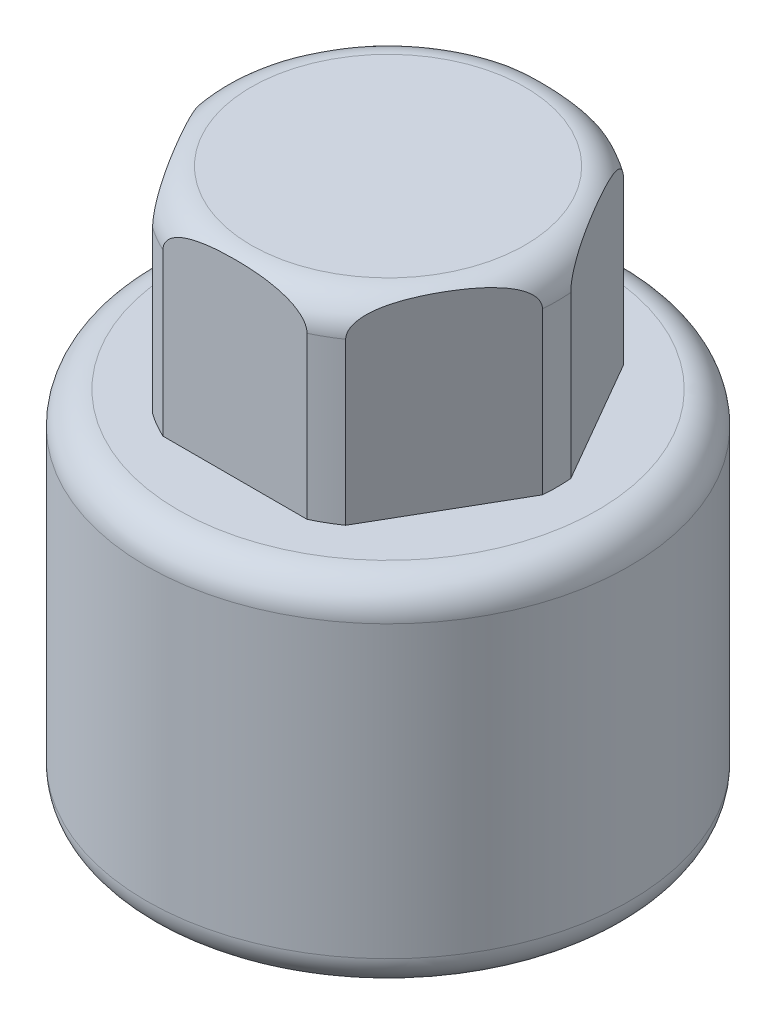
ISO-10303-21;
HEADER;
FILE_DESCRIPTION(('STEP AP214'),'2;1');
FILE_NAME('part.step','',(''),(''),'','','');
FILE_SCHEMA(('AUTOMOTIVE_DESIGN { 1 0 10303 214 1 1 1 1 }'));
ENDSEC;
DATA;
#1=APPLICATION_CONTEXT('core data for automotive mechanical design processes');
#2=APPLICATION_PROTOCOL_DEFINITION('international standard','automotive_design',2000,#1);
#3=PRODUCT_CONTEXT('',#1,'mechanical');
#4=PRODUCT('Part','Part','',(#3));
#5=PRODUCT_RELATED_PRODUCT_CATEGORY('part','',(#4));
#6=PRODUCT_DEFINITION_FORMATION('','',#4);
#7=PRODUCT_DEFINITION_CONTEXT('part definition',#1,'design');
#8=PRODUCT_DEFINITION('design','',#6,#7);
#9=PRODUCT_DEFINITION_SHAPE('','',#8);
#10=(LENGTH_UNIT() NAMED_UNIT(*) SI_UNIT(.MILLI.,.METRE.));
#11=(NAMED_UNIT(*) PLANE_ANGLE_UNIT() SI_UNIT($,.RADIAN.));
#12=(NAMED_UNIT(*) SI_UNIT($,.STERADIAN.) SOLID_ANGLE_UNIT());
#13=UNCERTAINTY_MEASURE_WITH_UNIT(LENGTH_MEASURE(1.E-05),#10,'distance_accuracy_value','');
#14=(GEOMETRIC_REPRESENTATION_CONTEXT(3) GLOBAL_UNCERTAINTY_ASSIGNED_CONTEXT((#13)) GLOBAL_UNIT_ASSIGNED_CONTEXT((#10,
#11,#12)) REPRESENTATION_CONTEXT('',''));
#15=CARTESIAN_POINT('',(0.,0.,0.));
#16=DIRECTION('',(0.,0.,1.));
#17=DIRECTION('',(1.,0.,0.));
#18=AXIS2_PLACEMENT_3D('',#15,#16,#17);
#19=CARTESIAN_POINT('',(0.,32.,0.));
#20=DIRECTION('',(0.,1.,0.));
#21=DIRECTION('',(0.,0.,1.));
#22=AXIS2_PLACEMENT_3D('',#19,#20,#21);
#23=TOROIDAL_SURFACE('',#22,8.5,2.);
#24=CARTESIAN_POINT('',(0.,34.,0.));
#25=DIRECTION('',(0.,1.,0.));
#26=DIRECTION('',(0.,0.,1.));
#27=AXIS2_PLACEMENT_3D('',#24,#25,#26);
#28=CIRCLE('',#27,8.5);
#29=CARTESIAN_POINT('',(0.,34.,8.5));
#30=VERTEX_POINT('',#29);
#31=EDGE_CURVE('E423',#30,#30,#28,.T.);
#32=ORIENTED_EDGE('',*,*,#31,.F.);
#33=EDGE_LOOP('',(#32));
#34=FACE_BOUND('',#33,.T.);
#35=CARTESIAN_POINT('',(0.,32.,0.));
#36=DIRECTION('',(0.,1.,0.));
#37=DIRECTION('',(0.,0.,1.));
#38=AXIS2_PLACEMENT_3D('',#35,#36,#37);
#39=CIRCLE('',#38,10.5);
#40=CARTESIAN_POINT('',(-10.463309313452,31.9999999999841,-0.877016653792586));
#41=VERTEX_POINT('',#40);
#42=CARTESIAN_POINT('',(-10.463309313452,32.,0.877016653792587));
#43=VERTEX_POINT('',#42);
#44=EDGE_CURVE('E233',#41,#43,#39,.T.);
#45=ORIENTED_EDGE('',*,*,#44,.T.);
#46=CARTESIAN_POINT('',(-10.4633093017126,31.9998,0.877016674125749));
#47=CARTESIAN_POINT('',(-10.4633151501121,32.0255748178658,0.877006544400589));
#48=CARTESIAN_POINT('',(-10.4627299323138,32.0513352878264,0.87802017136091));
#49=CARTESIAN_POINT('',(-10.4604078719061,32.1026269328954,0.882042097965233));
#50=CARTESIAN_POINT('',(-10.4586719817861,32.1281582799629,0.885048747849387));
#51=CARTESIAN_POINT('',(-10.4518263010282,32.2036890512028,0.896905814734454));
#52=CARTESIAN_POINT('',(-10.4450772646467,32.2531231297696,0.908595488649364));
#53=CARTESIAN_POINT('',(-10.4277701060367,32.3489976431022,0.938572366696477));
#54=CARTESIAN_POINT('',(-10.4172234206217,32.3954465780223,0.956839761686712));
#55=CARTESIAN_POINT('',(-10.3929801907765,32.4850160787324,0.998830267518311));
#56=CARTESIAN_POINT('',(-10.3792762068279,32.5281284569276,1.02256626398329));
#57=CARTESIAN_POINT('',(-10.3393454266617,32.6384592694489,1.09172840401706));
#58=CARTESIAN_POINT('',(-10.3108865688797,32.7024381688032,1.1410205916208));
#59=CARTESIAN_POINT('',(-10.2494090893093,32.8209067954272,1.24750270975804));
#60=CARTESIAN_POINT('',(-10.2163782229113,32.8753701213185,1.30471384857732));
#61=CARTESIAN_POINT('',(-10.151380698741,32.9701036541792,1.4172928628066));
#62=CARTESIAN_POINT('',(-10.1197411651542,33.0112887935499,1.47209414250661));
#63=CARTESIAN_POINT('',(-10.0548006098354,33.0880970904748,1.5845744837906));
#64=CARTESIAN_POINT('',(-10.0214982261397,33.1237155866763,1.64225590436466));
#65=CARTESIAN_POINT('',(-9.95366837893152,33.1901920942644,1.75974064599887));
#66=CARTESIAN_POINT('',(-9.91913891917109,33.2210418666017,1.81954742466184));
#67=CARTESIAN_POINT('',(-9.84924343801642,33.2785621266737,1.94060994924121));
#68=CARTESIAN_POINT('',(-9.81387771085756,33.3052340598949,2.00186518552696));
#69=CARTESIAN_POINT('',(-9.72699834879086,33.3657996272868,2.15234465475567));
#70=CARTESIAN_POINT('',(-9.67515338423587,33.3977866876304,2.24214276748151));
#71=CARTESIAN_POINT('',(-9.57061234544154,33.455686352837,2.42321315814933));
#72=CARTESIAN_POINT('',(-9.51791585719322,33.4815959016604,2.51448615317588));
#73=CARTESIAN_POINT('',(-9.41187844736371,33.5283990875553,2.69814833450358));
#74=CARTESIAN_POINT('',(-9.35853655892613,33.5492838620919,2.79053919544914));
#75=CARTESIAN_POINT('',(-9.25147600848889,33.5867921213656,2.97597350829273));
#76=CARTESIAN_POINT('',(-9.19775727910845,33.603414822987,3.06901707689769));
#77=CARTESIAN_POINT('',(-9.03559043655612,33.6480681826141,3.34989828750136));
#78=CARTESIAN_POINT('',(-8.92676463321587,33.6706226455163,3.53839010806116));
#79=CARTESIAN_POINT('',(-8.70883092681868,33.7047994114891,3.91586236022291));
#80=CARTESIAN_POINT('',(-8.59972341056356,33.7164325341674,4.10484212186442));
#81=CARTESIAN_POINT('',(-8.37807825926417,33.7308783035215,4.48874278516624));
#82=CARTESIAN_POINT('',(-8.26553619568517,33.7334150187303,4.68367135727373));
#83=CARTESIAN_POINT('',(-8.04043946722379,33.7293453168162,5.07355032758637));
#84=CARTESIAN_POINT('',(-7.92788482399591,33.7227343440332,5.26850068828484));
#85=CARTESIAN_POINT('',(-7.70379519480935,33.6993145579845,5.65663531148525));
#86=CARTESIAN_POINT('',(-7.59225853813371,33.6825765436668,5.84982246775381));
#87=CARTESIAN_POINT('',(-7.42549688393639,33.6477337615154,6.13866212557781));
#88=CARTESIAN_POINT('',(-7.3700162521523,33.6345021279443,6.23475739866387));
#89=CARTESIAN_POINT('',(-7.25931799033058,33.6042284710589,6.42649241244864));
#90=CARTESIAN_POINT('',(-7.20410033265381,33.5871868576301,6.52213220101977));
#91=CARTESIAN_POINT('',(-7.0786919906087,33.5432240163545,6.73934582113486));
#92=CARTESIAN_POINT('',(-7.00862363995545,33.5148728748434,6.86070776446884));
#93=CARTESIAN_POINT('',(-6.86917907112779,33.4487190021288,7.1022328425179));
#94=CARTESIAN_POINT('',(-6.79980850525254,33.4108668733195,7.22238618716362));
#95=CARTESIAN_POINT('',(-6.6849340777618,33.3371554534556,7.42135453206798));
#96=CARTESIAN_POINT('',(-6.63891156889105,33.304550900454,7.5010678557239));
#97=CARTESIAN_POINT('',(-6.54813391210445,33.2325843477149,7.65829936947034));
#98=CARTESIAN_POINT('',(-6.50337995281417,33.193216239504,7.73581550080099));
#99=CARTESIAN_POINT('',(-6.41620224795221,33.1066707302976,7.88681171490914));
#100=CARTESIAN_POINT('',(-6.3737631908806,33.0595559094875,7.96031831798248));
#101=CARTESIAN_POINT('',(-6.29199462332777,32.9556771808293,8.10194563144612));
#102=CARTESIAN_POINT('',(-6.25265760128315,32.8989377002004,8.17007935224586));
#103=CARTESIAN_POINT('',(-6.19115952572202,32.7947530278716,8.27659714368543));
#104=CARTESIAN_POINT('',(-6.16764629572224,32.7505215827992,8.3173232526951));
#105=CARTESIAN_POINT('',(-6.12357055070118,32.6563503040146,8.39366468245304));
#106=CARTESIAN_POINT('',(-6.10301060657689,32.6064055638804,8.42927555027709));
#107=CARTESIAN_POINT('',(-6.06574093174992,32.4999857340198,8.49382852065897));
#108=CARTESIAN_POINT('',(-6.04908462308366,32.4434343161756,8.52267809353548));
#109=CARTESIAN_POINT('',(-6.02146268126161,32.3250943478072,8.57052070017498));
#110=CARTESIAN_POINT('',(-6.0104744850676,32.2633277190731,8.58955281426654));
#111=CARTESIAN_POINT('',(-5.99908555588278,32.1672499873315,8.60927901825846));
#112=CARTESIAN_POINT('',(-5.99613452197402,32.1341052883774,8.61439035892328));
#113=CARTESIAN_POINT('',(-5.99216886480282,32.0672526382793,8.6212590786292));
#114=CARTESIAN_POINT('',(-5.99116034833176,32.0335432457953,8.62300588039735));
#115=CARTESIAN_POINT('',(-5.99117337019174,31.9998,8.62298332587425));
#116=B_SPLINE_CURVE_WITH_KNOTS('',3,(#46,#47,#48,#49,#50,#51,#52,#53,#54,#55,#56,#57,#58,#59,
#60,#61,#62,#63,#64,#65,#66,#67,#68,#69,#70,#71,#72,#73,#74,#75,#76,#77,#78,#79,#80,#81,#82,#83,
#84,#85,#86,#87,#88,#89,#90,#91,#92,#93,#94,#95,#96,#97,#98,#99,#100,#101,#102,#103,#104,#105,
#106,#107,#108,#109,#110,#111,#112,#113,#114,#115),.UNSPECIFIED.,.F.,.F.,(4,2,2,2,2,2,2,2,2,2,2,
2,2,2,2,2,2,2,2,2,2,2,2,2,2,2,2,2,2,2,2,2,2,2,4),(0.,0.0772701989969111,0.154476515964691,
0.307416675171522,0.45990004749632,0.612746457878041,0.868169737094,1.12429081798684,
1.35046583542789,1.57682924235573,1.80357947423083,2.03025107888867,2.35553925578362,
2.68099065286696,3.00701193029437,3.33309306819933,3.98912442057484,4.64450516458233,
5.31960566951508,5.99504250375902,6.66581100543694,7.00100065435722,7.3361542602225,
7.76484978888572,8.19582211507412,8.48856601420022,8.7815757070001,9.07232523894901,
9.36234760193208,9.55562009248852,9.74905982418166,9.94500962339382,10.140173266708,
10.2409642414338,10.342071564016),.UNSPECIFIED.);
#117=CARTESIAN_POINT('',(-5.99117335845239,31.9999999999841,8.62298334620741));
#118=VERTEX_POINT('',#117);
#119=EDGE_CURVE('E215',#43,#118,#116,.T.);
#120=ORIENTED_EDGE('',*,*,#119,.T.);
#121=CARTESIAN_POINT('',(-4.47213595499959,32.,9.5));
#122=VERTEX_POINT('',#121);
#123=EDGE_CURVE('E213',#118,#122,#39,.T.);
#124=ORIENTED_EDGE('',*,*,#123,.T.);
#125=CARTESIAN_POINT('',(0.,33.7320508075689,9.5));
#126=CARTESIAN_POINT('',(0.174542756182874,33.7320533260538,9.5));
#127=CARTESIAN_POINT('',(0.349088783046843,33.7292977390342,9.5));
#128=CARTESIAN_POINT('',(0.698026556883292,33.7179969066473,9.5));
#129=CARTESIAN_POINT('',(0.872418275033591,33.709450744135,9.5));
#130=CARTESIAN_POINT('',(1.2209830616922,33.6856743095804,9.5));
#131=CARTESIAN_POINT('',(1.39515555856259,33.6704354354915,9.5));
#132=CARTESIAN_POINT('',(1.74257347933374,33.6317445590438,9.5));
#133=CARTESIAN_POINT('',(1.9158191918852,33.6082952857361,9.5));
#134=CARTESIAN_POINT('',(2.19343214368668,33.5619974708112,9.5));
#135=CARTESIAN_POINT('',(2.29835167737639,33.5424704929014,9.5));
#136=CARTESIAN_POINT('',(2.50719955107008,33.4987204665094,9.5));
#137=CARTESIAN_POINT('',(2.61112809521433,33.4744984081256,9.5));
#138=CARTESIAN_POINT('',(2.81734503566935,33.4204804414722,9.5));
#139=CARTESIAN_POINT('',(2.91963607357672,33.3906947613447,9.5));
#140=CARTESIAN_POINT('',(3.1219735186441,33.3243586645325,9.5));
#141=CARTESIAN_POINT('',(3.2220211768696,33.287812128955,9.5));
#142=CARTESIAN_POINT('',(3.42311992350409,33.2046325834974,9.5));
#143=CARTESIAN_POINT('',(3.52401826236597,33.1576237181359,9.5));
#144=CARTESIAN_POINT('',(3.71993824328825,33.0523298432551,9.5));
#145=CARTESIAN_POINT('',(3.81496103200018,32.994047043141,9.5));
#146=CARTESIAN_POINT('',(3.97285063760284,32.8795625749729,9.5));
#147=CARTESIAN_POINT('',(4.03787755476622,32.8263757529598,9.5));
#148=CARTESIAN_POINT('',(4.15926206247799,32.7108383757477,9.5));
#149=CARTESIAN_POINT('',(4.21563870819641,32.648508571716,9.5));
#150=CARTESIAN_POINT('',(4.29955125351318,32.5353490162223,9.5));
#151=CARTESIAN_POINT('',(4.33056866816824,32.4871199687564,9.5));
#152=CARTESIAN_POINT('',(4.3846453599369,32.3863450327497,9.5));
#153=CARTESIAN_POINT('',(4.407710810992,32.3338025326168,9.5));
#154=CARTESIAN_POINT('',(4.44415320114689,32.2247630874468,9.5));
#155=CARTESIAN_POINT('',(4.45742540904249,32.1682302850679,9.5));
#156=CARTESIAN_POINT('',(4.47237647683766,32.0536565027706,9.5));
#157=CARTESIAN_POINT('',(4.47406669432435,31.9956170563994,9.5));
#158=CARTESIAN_POINT('',(4.46630653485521,31.8888566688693,9.5));
#159=CARTESIAN_POINT('',(4.458445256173,31.840011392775,9.5));
#160=CARTESIAN_POINT('',(4.43485052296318,31.7442743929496,9.5));
#161=CARTESIAN_POINT('',(4.41911350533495,31.6973835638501,9.5));
#162=CARTESIAN_POINT('',(4.37512785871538,31.5927886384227,9.5));
#163=CARTESIAN_POINT('',(4.34453974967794,31.5360739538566,9.5));
#164=CARTESIAN_POINT('',(4.2746457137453,31.4283138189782,9.5));
#165=CARTESIAN_POINT('',(4.23532205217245,31.3772802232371,9.5));
#166=CARTESIAN_POINT('',(4.12749241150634,31.2550015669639,9.5));
#167=CARTESIAN_POINT('',(4.05465201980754,31.1876108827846,9.5));
#168=CARTESIAN_POINT('',(3.89981059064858,31.0644997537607,9.5));
#169=CARTESIAN_POINT('',(3.81779029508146,31.0088045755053,9.5));
#170=CARTESIAN_POINT('',(3.65287479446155,30.9100103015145,9.5));
#171=CARTESIAN_POINT('',(3.57029489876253,30.8663748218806,9.5));
#172=CARTESIAN_POINT('',(3.40170224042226,30.7862394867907,9.5));
#173=CARTESIAN_POINT('',(3.31568630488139,30.7497464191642,9.5));
#174=CARTESIAN_POINT('',(3.14114216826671,30.6826531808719,9.5));
#175=CARTESIAN_POINT('',(3.05260765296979,30.6520696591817,9.5));
#176=CARTESIAN_POINT('',(2.87401190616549,30.5959745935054,9.5));
#177=CARTESIAN_POINT('',(2.78395137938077,30.5704607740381,9.5));
#178=CARTESIAN_POINT('',(2.54987002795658,30.5100549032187,9.5));
#179=CARTESIAN_POINT('',(2.40502285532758,30.4783759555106,9.5));
#180=CARTESIAN_POINT('',(2.11372750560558,30.4233450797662,9.5));
#181=CARTESIAN_POINT('',(1.9672784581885,30.3999979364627,9.5));
#182=CARTESIAN_POINT('',(1.67315892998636,30.3599257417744,9.5));
#183=CARTESIAN_POINT('',(1.52548644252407,30.3432157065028,9.5));
#184=CARTESIAN_POINT('',(1.22966842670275,30.3152835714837,9.5));
#185=CARTESIAN_POINT('',(1.08152300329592,30.3040603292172,9.5));
#186=CARTESIAN_POINT('',(0.784299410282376,30.2862366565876,9.5));
#187=CARTESIAN_POINT('',(0.63522002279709,30.279657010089,9.5));
#188=CARTESIAN_POINT('',(0.336928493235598,30.2707102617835,9.5));
#189=CARTESIAN_POINT('',(0.187716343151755,30.2683434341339,9.5));
#190=CARTESIAN_POINT('',(-0.110513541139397,30.26764551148,9.5));
#191=CARTESIAN_POINT('',(-0.25953126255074,30.2693089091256,9.5));
#192=CARTESIAN_POINT('',(-0.557452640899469,30.2767853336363,9.5));
#193=CARTESIAN_POINT('',(-0.706356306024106,30.2825980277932,9.5));
#194=CARTESIAN_POINT('',(-1.01601926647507,30.2994616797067,9.5));
#195=CARTESIAN_POINT('',(-1.17675814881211,30.3109001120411,9.5));
#196=CARTESIAN_POINT('',(-1.4977386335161,30.3401198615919,9.5));
#197=CARTESIAN_POINT('',(-1.65798001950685,30.3579036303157,9.5));
#198=CARTESIAN_POINT('',(-1.97649998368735,30.4012093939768,9.5));
#199=CARTESIAN_POINT('',(-2.1347845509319,30.4266862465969,9.5));
#200=CARTESIAN_POINT('',(-2.44939545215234,30.4875440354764,9.5));
#201=CARTESIAN_POINT('',(-2.60572311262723,30.5229178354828,9.5));
#202=CARTESIAN_POINT('',(-2.88212184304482,30.5977694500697,9.5));
#203=CARTESIAN_POINT('',(-3.00284997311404,30.6347852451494,9.5));
#204=CARTESIAN_POINT('',(-3.24114338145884,30.7191077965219,9.5));
#205=CARTESIAN_POINT('',(-3.35869882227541,30.7664431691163,9.5));
#206=CARTESIAN_POINT('',(-3.58907146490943,30.874716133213,9.5));
#207=CARTESIAN_POINT('',(-3.70182252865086,30.935797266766,9.5));
#208=CARTESIAN_POINT('',(-3.91619774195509,31.075022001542,9.5));
#209=CARTESIAN_POINT('',(-4.01787377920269,31.1530804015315,9.5));
#210=CARTESIAN_POINT('',(-4.15359208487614,31.2846267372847,9.5));
#211=CARTESIAN_POINT('',(-4.19545879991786,31.3300054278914,9.5));
#212=CARTESIAN_POINT('',(-4.27269786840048,31.4261022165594,9.5));
#213=CARTESIAN_POINT('',(-4.30806915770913,31.4768211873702,9.5));
#214=CARTESIAN_POINT('',(-4.37047428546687,31.584104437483,9.5));
#215=CARTESIAN_POINT('',(-4.39739980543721,31.6407331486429,9.5));
#216=CARTESIAN_POINT('',(-4.43969344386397,31.7581545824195,9.5));
#217=CARTESIAN_POINT('',(-4.45508457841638,31.8189387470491,9.5));
#218=CARTESIAN_POINT('',(-4.4713861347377,31.9348831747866,9.5));
#219=CARTESIAN_POINT('',(-4.47383172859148,31.9898268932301,9.5));
#220=CARTESIAN_POINT('',(-4.46811568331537,32.0991592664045,9.5));
#221=CARTESIAN_POINT('',(-4.45995379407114,32.1535479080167,9.5));
#222=CARTESIAN_POINT('',(-4.43541363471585,32.2537176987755,9.5));
#223=CARTESIAN_POINT('',(-4.42009433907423,32.2997670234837,9.5));
#224=CARTESIAN_POINT('',(-4.3829355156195,32.3891221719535,9.5));
#225=CARTESIAN_POINT('',(-4.36109430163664,32.432427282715,9.5));
#226=CARTESIAN_POINT('',(-4.29871783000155,32.5385712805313,9.5));
#227=CARTESIAN_POINT('',(-4.25447557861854,32.5992266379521,9.5));
#228=CARTESIAN_POINT('',(-4.15703345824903,32.7128664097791,9.5));
#229=CARTESIAN_POINT('',(-4.10380983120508,32.7658297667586,9.5));
#230=CARTESIAN_POINT('',(-4.00069389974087,32.8563673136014,9.5));
#231=CARTESIAN_POINT('',(-3.95174093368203,32.8950325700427,9.5));
#232=CARTESIAN_POINT('',(-3.85065529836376,32.9679890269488,9.5));
#233=CARTESIAN_POINT('',(-3.79852036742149,33.0022770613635,9.5));
#234=CARTESIAN_POINT('',(-3.6384525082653,33.0994127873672,9.5));
#235=CARTESIAN_POINT('',(-3.52698595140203,33.1564253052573,9.5));
#236=CARTESIAN_POINT('',(-3.26790790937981,33.2721084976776,9.5));
#237=CARTESIAN_POINT('',(-3.11868803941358,33.327040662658,9.5));
#238=CARTESIAN_POINT('',(-2.8155721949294,33.4225116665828,9.5));
#239=CARTESIAN_POINT('',(-2.6616678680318,33.4630229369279,9.5));
#240=CARTESIAN_POINT('',(-2.35087628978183,33.5331549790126,9.5));
#241=CARTESIAN_POINT('',(-2.19398017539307,33.5627353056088,9.5));
#242=CARTESIAN_POINT('',(-1.87896570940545,33.6132834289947,9.5));
#243=CARTESIAN_POINT('',(-1.72084835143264,33.6342576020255,9.5));
#244=CARTESIAN_POINT('',(-1.43255903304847,33.6661899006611,9.5));
#245=CARTESIAN_POINT('',(-1.30250743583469,33.6782736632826,9.5));
#246=CARTESIAN_POINT('',(-1.04209225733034,33.698525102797,9.5));
#247=CARTESIAN_POINT('',(-0.911728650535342,33.7066924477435,9.5));
#248=CARTESIAN_POINT('',(-0.651171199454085,33.7195582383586,9.5));
#249=CARTESIAN_POINT('',(-0.52097778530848,33.724265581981,9.5));
#250=CARTESIAN_POINT('',(-0.260523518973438,33.7305108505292,9.5));
#251=CARTESIAN_POINT('',(-0.130262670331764,33.7320489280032,9.5));
#252=CARTESIAN_POINT('',(0.,33.7320508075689,9.5));
#253=B_SPLINE_CURVE_WITH_KNOTS('',3,(#125,#126,#127,#128,#129,#130,#131,#132,#133,#134,#135,
#136,#137,#138,#139,#140,#141,#142,#143,#144,#145,#146,#147,#148,#149,#150,#151,#152,#153,#154,
#155,#156,#157,#158,#159,#160,#161,#162,#163,#164,#165,#166,#167,#168,#169,#170,#171,#172,#173,
#174,#175,#176,#177,#178,#179,#180,#181,#182,#183,#184,#185,#186,#187,#188,#189,#190,#191,#192,
#193,#194,#195,#196,#197,#198,#199,#200,#201,#202,#203,#204,#205,#206,#207,#208,#209,#210,#211,
#212,#213,#214,#215,#216,#217,#218,#219,#220,#221,#222,#223,#224,#225,#226,#227,#228,#229,#230,
#231,#232,#233,#234,#235,#236,#237,#238,#239,#240,#241,#242,#243,#244,#245,#246,#247,#248,#249,
#250,#251,#252),.UNSPECIFIED.,.T.,.F.,(4,2,2,2,2,2,2,2,2,2,2,2,2,2,2,2,2,2,2,2,2,2,2,2,2,2,2,2,
2,2,2,2,2,2,2,2,2,2,2,2,2,2,2,2,2,2,2,2,2,2,2,2,2,2,2,2,2,2,2,2,2,2,2,4),(0.,0.523611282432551,
1.04730551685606,1.57167482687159,2.0958700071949,2.41594892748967,2.73596042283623,
3.05538929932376,3.37463537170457,3.70805888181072,4.04141711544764,4.29277219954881,
4.54356538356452,4.71501165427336,4.88632451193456,5.05944388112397,5.23239346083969,
5.38011514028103,5.52790371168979,5.72014139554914,5.91277298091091,6.20879997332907,
6.50546005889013,6.78524084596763,7.06528624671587,7.34610947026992,7.62680636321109,
8.07126999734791,8.51598846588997,8.96170743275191,9.40733354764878,9.8549417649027,
10.3025791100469,10.7496050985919,11.1965952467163,11.6799281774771,12.1634480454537,
12.6441840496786,13.1245743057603,13.503068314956,13.8826255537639,14.2663472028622,
14.6481858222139,14.8329678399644,15.0177801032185,15.2048739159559,15.3915933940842,
15.5555747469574,15.7195599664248,15.8645870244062,16.0096516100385,16.2336016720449,
16.4581537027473,16.645030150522,16.832041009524,17.2065606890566,17.6825856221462,
18.1595157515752,18.638193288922,19.1165155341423,19.5082876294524,19.9000929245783,
20.290887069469,20.6816624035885),.UNSPECIFIED.);
#254=CARTESIAN_POINT('',(4.47213595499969,31.9999999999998,9.5));
#255=VERTEX_POINT('',#254);
#256=EDGE_CURVE('E841',#122,#255,#253,.T.);
#257=ORIENTED_EDGE('',*,*,#256,.T.);
#258=CARTESIAN_POINT('',(5.99117335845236,32.,8.62298334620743));
#259=VERTEX_POINT('',#258);
#260=EDGE_CURVE('E234',#255,#259,#39,.T.);
#261=ORIENTED_EDGE('',*,*,#260,.T.);
#262=CARTESIAN_POINT('',(5.99117337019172,31.9998,8.62298332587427));
#263=CARTESIAN_POINT('',(5.99116752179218,32.0255748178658,8.62299345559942));
#264=CARTESIAN_POINT('',(5.99175273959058,32.0513352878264,8.6219798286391));
#265=CARTESIAN_POINT('',(5.99407479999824,32.1026269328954,8.61795790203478));
#266=CARTESIAN_POINT('',(5.99581069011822,32.1281582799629,8.61495125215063));
#267=CARTESIAN_POINT('',(6.00265637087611,32.2036890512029,8.60309418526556));
#268=CARTESIAN_POINT('',(6.00940540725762,32.2531231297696,8.59140451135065));
#269=CARTESIAN_POINT('',(6.02671256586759,32.3489976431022,8.56142763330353));
#270=CARTESIAN_POINT('',(6.0372592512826,32.3954465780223,8.54316023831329));
#271=CARTESIAN_POINT('',(6.06150248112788,32.4850160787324,8.50116973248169));
#272=CARTESIAN_POINT('',(6.07520646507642,32.5281284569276,8.47743373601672));
#273=CARTESIAN_POINT('',(6.11513724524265,32.6384592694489,8.40827159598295));
#274=CARTESIAN_POINT('',(6.14359610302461,32.7024381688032,8.35897940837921));
#275=CARTESIAN_POINT('',(6.20507358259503,32.8209067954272,8.25249729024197));
#276=CARTESIAN_POINT('',(6.23810444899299,32.8753701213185,8.19528615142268));
#277=CARTESIAN_POINT('',(6.30310197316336,32.9701036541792,8.0827071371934));
#278=CARTESIAN_POINT('',(6.3347415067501,33.0112887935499,8.02790585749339));
#279=CARTESIAN_POINT('',(6.39968206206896,33.0880970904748,7.9154255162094));
#280=CARTESIAN_POINT('',(6.43298444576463,33.1237155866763,7.85774409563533));
#281=CARTESIAN_POINT('',(6.50081429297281,33.1901920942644,7.74025935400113));
#282=CARTESIAN_POINT('',(6.53534375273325,33.2210418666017,7.68045257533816));
#283=CARTESIAN_POINT('',(6.60523923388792,33.2785621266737,7.55939005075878));
#284=CARTESIAN_POINT('',(6.64060496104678,33.3052340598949,7.49813481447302));
#285=CARTESIAN_POINT('',(6.72748432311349,33.3657996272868,7.34765534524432));
#286=CARTESIAN_POINT('',(6.77932928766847,33.3977866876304,7.25785723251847));
#287=CARTESIAN_POINT('',(6.88387032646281,33.455686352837,7.07678684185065));
#288=CARTESIAN_POINT('',(6.93656681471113,33.4815959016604,6.9855138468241));
#289=CARTESIAN_POINT('',(7.04260422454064,33.5283990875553,6.80185166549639));
#290=CARTESIAN_POINT('',(7.09594611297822,33.5492838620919,6.70946080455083));
#291=CARTESIAN_POINT('',(7.20300666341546,33.5867921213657,6.52402649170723));
#292=CARTESIAN_POINT('',(7.25672539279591,33.6034148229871,6.43098292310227));
#293=CARTESIAN_POINT('',(7.41889223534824,33.6480681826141,6.15010171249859));
#294=CARTESIAN_POINT('',(7.52771803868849,33.6706226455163,5.96160989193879));
#295=CARTESIAN_POINT('',(7.7456517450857,33.7047994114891,5.58413763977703));
#296=CARTESIAN_POINT('',(7.85475926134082,33.7164325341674,5.39515787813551));
#297=CARTESIAN_POINT('',(8.07640441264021,33.7308783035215,5.01125721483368));
#298=CARTESIAN_POINT('',(8.18894647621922,33.7334150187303,4.81632864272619));
#299=CARTESIAN_POINT('',(8.4140432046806,33.7293453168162,4.42644967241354));
#300=CARTESIAN_POINT('',(8.52659784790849,33.7227343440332,4.23149931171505));
#301=CARTESIAN_POINT('',(8.75068747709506,33.6993145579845,3.84336468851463));
#302=CARTESIAN_POINT('',(8.8622241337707,33.6825765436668,3.65017753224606));
#303=CARTESIAN_POINT('',(9.02898578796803,33.6477337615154,3.36133787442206));
#304=CARTESIAN_POINT('',(9.08446641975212,33.6345021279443,3.26524260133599));
#305=CARTESIAN_POINT('',(9.19516468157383,33.6042284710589,3.07350758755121));
#306=CARTESIAN_POINT('',(9.25038233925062,33.58718685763,2.97786779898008));
#307=CARTESIAN_POINT('',(9.37579068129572,33.5432240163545,2.76065417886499));
#308=CARTESIAN_POINT('',(9.44585903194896,33.5148728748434,2.63929223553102));
#309=CARTESIAN_POINT('',(9.58530360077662,33.4487190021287,2.39776715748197));
#310=CARTESIAN_POINT('',(9.65467416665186,33.4108668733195,2.27761381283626));
#311=CARTESIAN_POINT('',(9.76954859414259,33.3371554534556,2.07864546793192));
#312=CARTESIAN_POINT('',(9.81557110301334,33.304550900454,1.998932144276));
#313=CARTESIAN_POINT('',(9.90634875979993,33.2325843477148,1.84170063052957));
#314=CARTESIAN_POINT('',(9.95110271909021,33.1932162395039,1.76418449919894));
#315=CARTESIAN_POINT('',(10.0382804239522,33.1066707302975,1.6131882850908));
#316=CARTESIAN_POINT('',(10.0807194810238,33.0595559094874,1.53968168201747));
#317=CARTESIAN_POINT('',(10.1624880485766,32.9556771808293,1.39805436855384));
#318=CARTESIAN_POINT('',(10.2018250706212,32.8989377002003,1.32992064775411));
#319=CARTESIAN_POINT('',(10.2633231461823,32.7947530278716,1.22340285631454));
#320=CARTESIAN_POINT('',(10.2868363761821,32.7505215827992,1.18267674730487));
#321=CARTESIAN_POINT('',(10.3309121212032,32.6563503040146,1.10633531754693));
#322=CARTESIAN_POINT('',(10.3514720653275,32.6064055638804,1.07072444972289));
#323=CARTESIAN_POINT('',(10.3887417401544,32.4999857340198,1.006171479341));
#324=CARTESIAN_POINT('',(10.4053980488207,32.4434343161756,0.977321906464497));
#325=CARTESIAN_POINT('',(10.4330199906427,32.3250943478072,0.929479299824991));
#326=CARTESIAN_POINT('',(10.4440081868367,32.2633277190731,0.91044718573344));
#327=CARTESIAN_POINT('',(10.4553971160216,32.1672499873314,0.89072098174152));
#328=CARTESIAN_POINT('',(10.4583481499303,32.1341052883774,0.885609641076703));
#329=CARTESIAN_POINT('',(10.4623138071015,32.0672526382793,0.878740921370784));
#330=CARTESIAN_POINT('',(10.4633223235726,32.0335432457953,0.876994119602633));
#331=CARTESIAN_POINT('',(10.4633093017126,31.9998,0.877016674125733));
#332=B_SPLINE_CURVE_WITH_KNOTS('',3,(#262,#263,#264,#265,#266,#267,#268,#269,#270,#271,#272,
#273,#274,#275,#276,#277,#278,#279,#280,#281,#282,#283,#284,#285,#286,#287,#288,#289,#290,#291,
#292,#293,#294,#295,#296,#297,#298,#299,#300,#301,#302,#303,#304,#305,#306,#307,#308,#309,#310,
#311,#312,#313,#314,#315,#316,#317,#318,#319,#320,#321,#322,#323,#324,#325,#326,#327,#328,#329,
#330,#331),.UNSPECIFIED.,.F.,.F.,(4,2,2,2,2,2,2,2,2,2,2,2,2,2,2,2,2,2,2,2,2,2,2,2,2,2,2,2,2,2,2,
2,2,2,4),(0.,0.0772701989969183,0.154476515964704,0.30741667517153,0.459900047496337,
0.61274645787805,0.86816973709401,1.12429081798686,1.35046583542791,1.57682924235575,
1.80357947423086,2.0302510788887,2.35553925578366,2.68099065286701,3.00701193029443,
3.3330930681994,3.98912442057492,4.64450516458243,5.3196056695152,5.99504250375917,
6.66581100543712,7.00100065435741,7.33615426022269,7.7648497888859,8.19582211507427,
8.48856601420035,8.78157570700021,9.07232523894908,9.36234760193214,9.55562009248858,
9.74905982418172,9.94500962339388,10.1401732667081,10.2409642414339,10.342071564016),.UNSPECIFIED.);
#333=CARTESIAN_POINT('',(10.463309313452,31.9999999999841,0.877016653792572));
#334=VERTEX_POINT('',#333);
#335=EDGE_CURVE('E829',#259,#334,#332,.T.);
#336=ORIENTED_EDGE('',*,*,#335,.T.);
#337=CARTESIAN_POINT('',(10.463309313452,32.,-0.877016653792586));
#338=VERTEX_POINT('',#337);
#339=EDGE_CURVE('E418',#334,#338,#39,.T.);
#340=ORIENTED_EDGE('',*,*,#339,.T.);
#341=CARTESIAN_POINT('',(10.4633093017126,31.9998,-0.877016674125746));
#342=CARTESIAN_POINT('',(10.4633151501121,32.0255748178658,-0.877006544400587));
#343=CARTESIAN_POINT('',(10.4627299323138,32.0513352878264,-0.878020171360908));
#344=CARTESIAN_POINT('',(10.4604078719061,32.1026269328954,-0.88204209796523));
#345=CARTESIAN_POINT('',(10.4586719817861,32.1281582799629,-0.885048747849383));
#346=CARTESIAN_POINT('',(10.4518263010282,32.2036890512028,-0.896905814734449));
#347=CARTESIAN_POINT('',(10.4450772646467,32.2531231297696,-0.908595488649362));
#348=CARTESIAN_POINT('',(10.4277701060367,32.3489976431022,-0.938572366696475));
#349=CARTESIAN_POINT('',(10.4172234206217,32.3954465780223,-0.956839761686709));
#350=CARTESIAN_POINT('',(10.3929801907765,32.4850160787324,-0.998830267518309));
#351=CARTESIAN_POINT('',(10.3792762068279,32.5281284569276,-1.02256626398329));
#352=CARTESIAN_POINT('',(10.3393454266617,32.6384592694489,-1.09172840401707));
#353=CARTESIAN_POINT('',(10.3108865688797,32.7024381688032,-1.1410205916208));
#354=CARTESIAN_POINT('',(10.2494090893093,32.8209067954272,-1.24750270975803));
#355=CARTESIAN_POINT('',(10.2163782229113,32.8753701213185,-1.30471384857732));
#356=CARTESIAN_POINT('',(10.151380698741,32.9701036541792,-1.41729286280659));
#357=CARTESIAN_POINT('',(10.1197411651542,33.0112887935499,-1.47209414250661));
#358=CARTESIAN_POINT('',(10.0548006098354,33.0880970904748,-1.58457448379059));
#359=CARTESIAN_POINT('',(10.0214982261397,33.1237155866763,-1.64225590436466));
#360=CARTESIAN_POINT('',(9.95366837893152,33.1901920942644,-1.75974064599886));
#361=CARTESIAN_POINT('',(9.91913891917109,33.2210418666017,-1.81954742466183));
#362=CARTESIAN_POINT('',(9.84924343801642,33.2785621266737,-1.9406099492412));
#363=CARTESIAN_POINT('',(9.81387771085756,33.3052340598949,-2.00186518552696));
#364=CARTESIAN_POINT('',(9.72699834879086,33.3657996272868,-2.15234465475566));
#365=CARTESIAN_POINT('',(9.67515338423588,33.3977866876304,-2.2421427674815));
#366=CARTESIAN_POINT('',(9.57061234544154,33.455686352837,-2.42321315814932));
#367=CARTESIAN_POINT('',(9.51791585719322,33.4815959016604,-2.51448615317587));
#368=CARTESIAN_POINT('',(9.41187844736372,33.5283990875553,-2.69814833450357));
#369=CARTESIAN_POINT('',(9.35853655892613,33.5492838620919,-2.79053919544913));
#370=CARTESIAN_POINT('',(9.25147600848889,33.5867921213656,-2.97597350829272));
#371=CARTESIAN_POINT('',(9.19775727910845,33.603414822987,-3.06901707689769));
#372=CARTESIAN_POINT('',(9.03559043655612,33.6480681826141,-3.34989828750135));
#373=CARTESIAN_POINT('',(8.92676463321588,33.6706226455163,-3.53839010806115));
#374=CARTESIAN_POINT('',(8.70883092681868,33.7047994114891,-3.9158623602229));
#375=CARTESIAN_POINT('',(8.59972341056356,33.7164325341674,-4.10484212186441));
#376=CARTESIAN_POINT('',(8.37807825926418,33.7308783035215,-4.48874278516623));
#377=CARTESIAN_POINT('',(8.26553619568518,33.7334150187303,-4.68367135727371));
#378=CARTESIAN_POINT('',(8.0404394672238,33.7293453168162,-5.07355032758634));
#379=CARTESIAN_POINT('',(7.92788482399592,33.7227343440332,-5.26850068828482));
#380=CARTESIAN_POINT('',(7.70379519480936,33.6993145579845,-5.65663531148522));
#381=CARTESIAN_POINT('',(7.59225853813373,33.6825765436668,-5.84982246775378));
#382=CARTESIAN_POINT('',(7.4254968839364,33.6477337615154,-6.13866212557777));
#383=CARTESIAN_POINT('',(7.37001625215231,33.6345021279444,-6.23475739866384));
#384=CARTESIAN_POINT('',(7.2593179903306,33.6042284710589,-6.42649241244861));
#385=CARTESIAN_POINT('',(7.20410033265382,33.5871868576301,-6.52213220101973));
#386=CARTESIAN_POINT('',(7.07869199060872,33.5432240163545,-6.73934582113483));
#387=CARTESIAN_POINT('',(7.00862363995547,33.5148728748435,-6.86070776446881));
#388=CARTESIAN_POINT('',(6.8691790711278,33.4487190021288,-7.10223284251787));
#389=CARTESIAN_POINT('',(6.79980850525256,33.4108668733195,-7.2223861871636));
#390=CARTESIAN_POINT('',(6.68493407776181,33.3371554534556,-7.42135453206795));
#391=CARTESIAN_POINT('',(6.63891156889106,33.304550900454,-7.50106785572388));
#392=CARTESIAN_POINT('',(6.54813391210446,33.2325843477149,-7.65829936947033));
#393=CARTESIAN_POINT('',(6.50337995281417,33.193216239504,-7.73581550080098));
#394=CARTESIAN_POINT('',(6.41620224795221,33.1066707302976,-7.88681171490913));
#395=CARTESIAN_POINT('',(6.37376319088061,33.0595559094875,-7.96031831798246));
#396=CARTESIAN_POINT('',(6.29199462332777,32.9556771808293,-8.10194563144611));
#397=CARTESIAN_POINT('',(6.25265760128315,32.8989377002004,-8.17007935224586));
#398=CARTESIAN_POINT('',(6.19115952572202,32.7947530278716,-8.27659714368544));
#399=CARTESIAN_POINT('',(6.16764629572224,32.7505215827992,-8.31732325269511));
#400=CARTESIAN_POINT('',(6.12357055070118,32.6563503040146,-8.39366468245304));
#401=CARTESIAN_POINT('',(6.10301060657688,32.6064055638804,-8.42927555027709));
#402=CARTESIAN_POINT('',(6.06574093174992,32.4999857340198,-8.49382852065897));
#403=CARTESIAN_POINT('',(6.04908462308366,32.4434343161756,-8.52267809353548));
#404=CARTESIAN_POINT('',(6.02146268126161,32.3250943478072,-8.57052070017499));
#405=CARTESIAN_POINT('',(6.0104744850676,32.2633277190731,-8.58955281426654));
#406=CARTESIAN_POINT('',(5.99908555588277,32.1672499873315,-8.60927901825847));
#407=CARTESIAN_POINT('',(5.99613452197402,32.1341052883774,-8.61439035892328));
#408=CARTESIAN_POINT('',(5.99216886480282,32.0672526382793,-8.6212590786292));
#409=CARTESIAN_POINT('',(5.99116034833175,32.0335432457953,-8.62300588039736));
#410=CARTESIAN_POINT('',(5.99117337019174,31.9998,-8.62298332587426));
#411=B_SPLINE_CURVE_WITH_KNOTS('',3,(#341,#342,#343,#344,#345,#346,#347,#348,#349,#350,#351,
#352,#353,#354,#355,#356,#357,#358,#359,#360,#361,#362,#363,#364,#365,#366,#367,#368,#369,#370,
#371,#372,#373,#374,#375,#376,#377,#378,#379,#380,#381,#382,#383,#384,#385,#386,#387,#388,#389,
#390,#391,#392,#393,#394,#395,#396,#397,#398,#399,#400,#401,#402,#403,#404,#405,#406,#407,#408,
#409,#410),.UNSPECIFIED.,.F.,.F.,(4,2,2,2,2,2,2,2,2,2,2,2,2,2,2,2,2,2,2,2,2,2,2,2,2,2,2,2,2,2,2,
2,2,2,4),(0.,0.077270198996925,0.154476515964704,0.30741667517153,0.459900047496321,
0.612746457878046,0.868169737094,1.12429081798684,1.35046583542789,1.57682924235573,
1.80357947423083,2.03025107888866,2.35553925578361,2.68099065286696,3.00701193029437,
3.33309306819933,3.98912442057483,4.64450516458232,5.31960566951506,5.995042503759,
6.66581100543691,7.00100065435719,7.33615426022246,7.76484978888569,8.19582211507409,
8.48856601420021,8.78157570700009,9.072325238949,9.3623476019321,9.55562009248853,
9.74905982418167,9.94500962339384,10.140173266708,10.2409642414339,10.342071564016),.UNSPECIFIED.);
#412=CARTESIAN_POINT('',(5.99117335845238,31.9999999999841,-8.62298334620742));
#413=VERTEX_POINT('',#412);
#414=EDGE_CURVE('E811',#338,#413,#411,.T.);
#415=ORIENTED_EDGE('',*,*,#414,.T.);
#416=CARTESIAN_POINT('',(4.47213595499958,32.,-9.5));
#417=VERTEX_POINT('',#416);
#418=EDGE_CURVE('E412',#413,#417,#39,.T.);
#419=ORIENTED_EDGE('',*,*,#418,.T.);
#420=CARTESIAN_POINT('',(0.,33.7320508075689,-9.5));
#421=CARTESIAN_POINT('',(-0.174542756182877,33.7320533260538,-9.5));
#422=CARTESIAN_POINT('',(-0.349088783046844,33.7292977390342,-9.5));
#423=CARTESIAN_POINT('',(-0.698026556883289,33.7179969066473,-9.5));
#424=CARTESIAN_POINT('',(-0.872418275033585,33.709450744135,-9.5));
#425=CARTESIAN_POINT('',(-1.22098306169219,33.6856743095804,-9.5));
#426=CARTESIAN_POINT('',(-1.39515555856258,33.6704354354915,-9.5));
#427=CARTESIAN_POINT('',(-1.74257347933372,33.6317445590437,-9.5));
#428=CARTESIAN_POINT('',(-1.91581919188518,33.6082952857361,-9.5));
#429=CARTESIAN_POINT('',(-2.19343214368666,33.5619974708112,-9.5));
#430=CARTESIAN_POINT('',(-2.29835167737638,33.5424704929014,-9.5));
#431=CARTESIAN_POINT('',(-2.50719955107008,33.4987204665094,-9.5));
#432=CARTESIAN_POINT('',(-2.61112809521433,33.4744984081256,-9.5));
#433=CARTESIAN_POINT('',(-2.81734503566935,33.4204804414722,-9.5));
#434=CARTESIAN_POINT('',(-2.91963607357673,33.3906947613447,-9.5));
#435=CARTESIAN_POINT('',(-3.1219735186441,33.3243586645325,-9.5));
#436=CARTESIAN_POINT('',(-3.22202117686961,33.287812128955,-9.5));
#437=CARTESIAN_POINT('',(-3.4231199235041,33.2046325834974,-9.5));
#438=CARTESIAN_POINT('',(-3.52401826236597,33.1576237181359,-9.5));
#439=CARTESIAN_POINT('',(-3.71993824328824,33.0523298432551,-9.5));
#440=CARTESIAN_POINT('',(-3.81496103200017,32.994047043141,-9.5));
#441=CARTESIAN_POINT('',(-3.97285063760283,32.8795625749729,-9.5));
#442=CARTESIAN_POINT('',(-4.03787755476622,32.8263757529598,-9.5));
#443=CARTESIAN_POINT('',(-4.15926206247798,32.7108383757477,-9.5));
#444=CARTESIAN_POINT('',(-4.21563870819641,32.648508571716,-9.5));
#445=CARTESIAN_POINT('',(-4.29955125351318,32.5353490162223,-9.5));
#446=CARTESIAN_POINT('',(-4.33056866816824,32.4871199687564,-9.5));
#447=CARTESIAN_POINT('',(-4.38464535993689,32.3863450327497,-9.5));
#448=CARTESIAN_POINT('',(-4.40771081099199,32.3338025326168,-9.5));
#449=CARTESIAN_POINT('',(-4.44415320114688,32.2247630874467,-9.5));
#450=CARTESIAN_POINT('',(-4.45742540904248,32.1682302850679,-9.5));
#451=CARTESIAN_POINT('',(-4.47237647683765,32.0536565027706,-9.5));
#452=CARTESIAN_POINT('',(-4.47406669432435,31.9956170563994,-9.5));
#453=CARTESIAN_POINT('',(-4.4663065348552,31.8888566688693,-9.5));
#454=CARTESIAN_POINT('',(-4.45844525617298,31.840011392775,-9.5));
#455=CARTESIAN_POINT('',(-4.43485052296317,31.7442743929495,-9.5));
#456=CARTESIAN_POINT('',(-4.41911350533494,31.6973835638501,-9.5));
#457=CARTESIAN_POINT('',(-4.37512785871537,31.5927886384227,-9.5));
#458=CARTESIAN_POINT('',(-4.34453974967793,31.5360739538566,-9.5));
#459=CARTESIAN_POINT('',(-4.27464571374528,31.4283138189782,-9.5));
#460=CARTESIAN_POINT('',(-4.23532205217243,31.3772802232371,-9.5));
#461=CARTESIAN_POINT('',(-4.12749241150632,31.2550015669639,-9.5));
#462=CARTESIAN_POINT('',(-4.05465201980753,31.1876108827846,-9.5));
#463=CARTESIAN_POINT('',(-3.89981059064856,31.0644997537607,-9.5));
#464=CARTESIAN_POINT('',(-3.81779029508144,31.0088045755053,-9.5));
#465=CARTESIAN_POINT('',(-3.65287479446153,30.9100103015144,-9.5));
#466=CARTESIAN_POINT('',(-3.57029489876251,30.8663748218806,-9.5));
#467=CARTESIAN_POINT('',(-3.40170224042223,30.7862394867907,-9.5));
#468=CARTESIAN_POINT('',(-3.31568630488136,30.7497464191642,-9.5));
#469=CARTESIAN_POINT('',(-3.14114216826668,30.6826531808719,-9.5));
#470=CARTESIAN_POINT('',(-3.05260765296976,30.6520696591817,-9.5));
#471=CARTESIAN_POINT('',(-2.87401190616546,30.5959745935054,-9.5));
#472=CARTESIAN_POINT('',(-2.78395137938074,30.5704607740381,-9.5));
#473=CARTESIAN_POINT('',(-2.54987002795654,30.5100549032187,-9.5));
#474=CARTESIAN_POINT('',(-2.40502285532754,30.4783759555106,-9.5));
#475=CARTESIAN_POINT('',(-2.11372750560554,30.4233450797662,-9.5));
#476=CARTESIAN_POINT('',(-1.96727845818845,30.3999979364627,-9.5));
#477=CARTESIAN_POINT('',(-1.67315892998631,30.3599257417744,-9.5));
#478=CARTESIAN_POINT('',(-1.52548644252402,30.3432157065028,-9.5));
#479=CARTESIAN_POINT('',(-1.22966842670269,30.3152835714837,-9.5));
#480=CARTESIAN_POINT('',(-1.08152300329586,30.3040603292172,-9.5));
#481=CARTESIAN_POINT('',(-0.78429941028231,30.2862366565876,-9.5));
#482=CARTESIAN_POINT('',(-0.635220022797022,30.279657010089,-9.5));
#483=CARTESIAN_POINT('',(-0.336928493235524,30.2707102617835,-9.5));
#484=CARTESIAN_POINT('',(-0.187716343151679,30.2683434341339,-9.5));
#485=CARTESIAN_POINT('',(0.110513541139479,30.26764551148,-9.5));
#486=CARTESIAN_POINT('',(0.259531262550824,30.2693089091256,-9.5));
#487=CARTESIAN_POINT('',(0.557452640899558,30.2767853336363,-9.5));
#488=CARTESIAN_POINT('',(0.706356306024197,30.2825980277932,-9.5));
#489=CARTESIAN_POINT('',(1.01601926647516,30.2994616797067,-9.5));
#490=CARTESIAN_POINT('',(1.17675814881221,30.3109001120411,-9.5));
#491=CARTESIAN_POINT('',(1.4977386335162,30.3401198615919,-9.5));
#492=CARTESIAN_POINT('',(1.65798001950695,30.3579036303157,-9.5));
#493=CARTESIAN_POINT('',(1.97649998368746,30.4012093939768,-9.5));
#494=CARTESIAN_POINT('',(2.13478455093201,30.4266862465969,-9.5));
#495=CARTESIAN_POINT('',(2.44939545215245,30.4875440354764,-9.5));
#496=CARTESIAN_POINT('',(2.60572311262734,30.5229178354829,-9.5));
#497=CARTESIAN_POINT('',(2.88212184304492,30.5977694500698,-9.5));
#498=CARTESIAN_POINT('',(3.00284997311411,30.6347852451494,-9.5));
#499=CARTESIAN_POINT('',(3.24114338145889,30.7191077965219,-9.5));
#500=CARTESIAN_POINT('',(3.35869882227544,30.7664431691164,-9.5));
#501=CARTESIAN_POINT('',(3.58907146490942,30.874716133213,-9.5));
#502=CARTESIAN_POINT('',(3.70182252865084,30.935797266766,-9.5));
#503=CARTESIAN_POINT('',(3.91619774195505,31.0750220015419,-9.5));
#504=CARTESIAN_POINT('',(4.01787377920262,31.1530804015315,-9.5));
#505=CARTESIAN_POINT('',(4.15359208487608,31.2846267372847,-9.5));
#506=CARTESIAN_POINT('',(4.1954587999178,31.3300054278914,-9.5));
#507=CARTESIAN_POINT('',(4.27269786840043,31.4261022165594,-9.5));
#508=CARTESIAN_POINT('',(4.30806915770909,31.4768211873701,-9.5));
#509=CARTESIAN_POINT('',(4.37047428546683,31.584104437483,-9.5));
#510=CARTESIAN_POINT('',(4.39739980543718,31.6407331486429,-9.5));
#511=CARTESIAN_POINT('',(4.43969344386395,31.7581545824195,-9.5));
#512=CARTESIAN_POINT('',(4.45508457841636,31.8189387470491,-9.5));
#513=CARTESIAN_POINT('',(4.47138613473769,31.9348831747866,-9.5));
#514=CARTESIAN_POINT('',(4.47383172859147,31.9898268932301,-9.5));
#515=CARTESIAN_POINT('',(4.46811568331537,32.0991592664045,-9.5));
#516=CARTESIAN_POINT('',(4.45995379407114,32.1535479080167,-9.5));
#517=CARTESIAN_POINT('',(4.43541363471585,32.2537176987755,-9.5));
#518=CARTESIAN_POINT('',(4.42009433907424,32.2997670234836,-9.5));
#519=CARTESIAN_POINT('',(4.3829355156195,32.3891221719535,-9.5));
#520=CARTESIAN_POINT('',(4.36109430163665,32.432427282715,-9.5));
#521=CARTESIAN_POINT('',(4.29871783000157,32.5385712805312,-9.5));
#522=CARTESIAN_POINT('',(4.25447557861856,32.5992266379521,-9.5));
#523=CARTESIAN_POINT('',(4.15703345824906,32.7128664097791,-9.5));
#524=CARTESIAN_POINT('',(4.10380983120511,32.7658297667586,-9.5));
#525=CARTESIAN_POINT('',(4.0006938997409,32.8563673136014,-9.5));
#526=CARTESIAN_POINT('',(3.95174093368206,32.8950325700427,-9.5));
#527=CARTESIAN_POINT('',(3.8506552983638,32.9679890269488,-9.5));
#528=CARTESIAN_POINT('',(3.79852036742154,33.0022770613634,-9.5));
#529=CARTESIAN_POINT('',(3.63845250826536,33.0994127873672,-9.5));
#530=CARTESIAN_POINT('',(3.52698595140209,33.1564253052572,-9.5));
#531=CARTESIAN_POINT('',(3.2679079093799,33.2721084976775,-9.5));
#532=CARTESIAN_POINT('',(3.11868803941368,33.3270406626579,-9.5));
#533=CARTESIAN_POINT('',(2.81557219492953,33.4225116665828,-9.5));
#534=CARTESIAN_POINT('',(2.66166786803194,33.4630229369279,-9.5));
#535=CARTESIAN_POINT('',(2.350876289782,33.5331549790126,-9.5));
#536=CARTESIAN_POINT('',(2.19398017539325,33.5627353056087,-9.5));
#537=CARTESIAN_POINT('',(1.87896570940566,33.6132834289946,-9.5));
#538=CARTESIAN_POINT('',(1.72084835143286,33.6342576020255,-9.5));
#539=CARTESIAN_POINT('',(1.43255903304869,33.6661899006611,-9.5));
#540=CARTESIAN_POINT('',(1.30250743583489,33.6782736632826,-9.5));
#541=CARTESIAN_POINT('',(1.0420922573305,33.698525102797,-9.5));
#542=CARTESIAN_POINT('',(0.911728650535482,33.7066924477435,-9.5));
#543=CARTESIAN_POINT('',(0.651171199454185,33.7195582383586,-9.5));
#544=CARTESIAN_POINT('',(0.520977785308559,33.724265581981,-9.5));
#545=CARTESIAN_POINT('',(0.260523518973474,33.7305108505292,-9.5));
#546=CARTESIAN_POINT('',(0.13026267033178,33.7320489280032,-9.5));
#547=CARTESIAN_POINT('',(0.,33.7320508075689,-9.5));
#548=B_SPLINE_CURVE_WITH_KNOTS('',3,(#420,#421,#422,#423,#424,#425,#426,#427,#428,#429,#430,
#431,#432,#433,#434,#435,#436,#437,#438,#439,#440,#441,#442,#443,#444,#445,#446,#447,#448,#449,
#450,#451,#452,#453,#454,#455,#456,#457,#458,#459,#460,#461,#462,#463,#464,#465,#466,#467,#468,
#469,#470,#471,#472,#473,#474,#475,#476,#477,#478,#479,#480,#481,#482,#483,#484,#485,#486,#487,
#488,#489,#490,#491,#492,#493,#494,#495,#496,#497,#498,#499,#500,#501,#502,#503,#504,#505,#506,
#507,#508,#509,#510,#511,#512,#513,#514,#515,#516,#517,#518,#519,#520,#521,#522,#523,#524,#525,
#526,#527,#528,#529,#530,#531,#532,#533,#534,#535,#536,#537,#538,#539,#540,#541,#542,#543,#544,
#545,#546,#547),.UNSPECIFIED.,.T.,.F.,(4,2,2,2,2,2,2,2,2,2,2,2,2,2,2,2,2,2,2,2,2,2,2,2,2,2,2,2,
2,2,2,2,2,2,2,2,2,2,2,2,2,2,2,2,2,2,2,2,2,2,2,2,2,2,2,2,2,2,2,2,2,2,2,4),(0.,0.523611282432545,
1.04730551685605,1.57167482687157,2.09587000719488,2.41594892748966,2.73596042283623,
3.05538929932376,3.37463537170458,3.70805888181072,4.04141711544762,4.29277219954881,
4.54356538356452,4.71501165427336,4.88632451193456,5.05944388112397,5.23239346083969,
5.38011514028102,5.52790371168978,5.72014139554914,5.9127729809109,6.20879997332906,
6.50546005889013,6.78524084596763,7.06528624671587,7.34610947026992,7.6268063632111,
8.07126999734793,8.51598846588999,8.96170743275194,9.40733354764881,9.85494176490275,
10.302579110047,10.7496050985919,11.1965952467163,11.6799281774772,12.1634480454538,
12.6441840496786,13.1245743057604,13.5030683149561,13.8826255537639,14.2663472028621,
14.6481858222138,14.8329678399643,15.0177801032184,15.2048739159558,15.3915933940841,
15.5555747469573,15.7195599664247,15.8645870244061,16.0096516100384,16.2336016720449,
16.4581537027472,16.6450301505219,16.8320410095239,17.2065606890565,17.6825856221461,
18.159515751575,18.6381932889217,19.116515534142,19.5082876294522,19.9000929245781,
20.2908870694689,20.6816624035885),.UNSPECIFIED.);
#549=CARTESIAN_POINT('',(-4.47213595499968,31.9999999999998,-9.5));
#550=VERTEX_POINT('',#549);
#551=EDGE_CURVE('E815',#417,#550,#548,.T.);
#552=ORIENTED_EDGE('',*,*,#551,.T.);
#553=CARTESIAN_POINT('',(-5.99117335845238,32.,-8.62298334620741));
#554=VERTEX_POINT('',#553);
#555=EDGE_CURVE('E419',#550,#554,#39,.T.);
#556=ORIENTED_EDGE('',*,*,#555,.T.);
#557=CARTESIAN_POINT('',(-5.99117337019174,31.9998,-8.62298332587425));
#558=CARTESIAN_POINT('',(-5.99116752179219,32.0255748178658,-8.62299345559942));
#559=CARTESIAN_POINT('',(-5.99175273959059,32.0513352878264,-8.62197982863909));
#560=CARTESIAN_POINT('',(-5.99407479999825,32.1026269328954,-8.61795790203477));
#561=CARTESIAN_POINT('',(-5.99581069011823,32.1281582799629,-8.61495125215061));
#562=CARTESIAN_POINT('',(-6.00265637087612,32.2036890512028,-8.60309418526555));
#563=CARTESIAN_POINT('',(-6.00940540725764,32.2531231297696,-8.59140451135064));
#564=CARTESIAN_POINT('',(-6.0267125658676,32.3489976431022,-8.56142763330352));
#565=CARTESIAN_POINT('',(-6.03725925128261,32.3954465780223,-8.54316023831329));
#566=CARTESIAN_POINT('',(-6.06150248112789,32.4850160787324,-8.50116973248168));
#567=CARTESIAN_POINT('',(-6.07520646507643,32.5281284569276,-8.47743373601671));
#568=CARTESIAN_POINT('',(-6.11513724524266,32.6384592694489,-8.40827159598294));
#569=CARTESIAN_POINT('',(-6.14359610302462,32.7024381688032,-8.3589794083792));
#570=CARTESIAN_POINT('',(-6.20507358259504,32.8209067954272,-8.25249729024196));
#571=CARTESIAN_POINT('',(-6.238104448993,32.8753701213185,-8.19528615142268));
#572=CARTESIAN_POINT('',(-6.30310197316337,32.9701036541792,-8.0827071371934));
#573=CARTESIAN_POINT('',(-6.33474150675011,33.0112887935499,-8.02790585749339));
#574=CARTESIAN_POINT('',(-6.39968206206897,33.0880970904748,-7.9154255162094));
#575=CARTESIAN_POINT('',(-6.43298444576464,33.1237155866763,-7.85774409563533));
#576=CARTESIAN_POINT('',(-6.50081429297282,33.1901920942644,-7.74025935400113));
#577=CARTESIAN_POINT('',(-6.53534375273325,33.2210418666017,-7.68045257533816));
#578=CARTESIAN_POINT('',(-6.60523923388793,33.2785621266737,-7.55939005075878));
#579=CARTESIAN_POINT('',(-6.64060496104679,33.3052340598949,-7.49813481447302));
#580=CARTESIAN_POINT('',(-6.72748432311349,33.3657996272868,-7.34765534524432));
#581=CARTESIAN_POINT('',(-6.77932928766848,33.3977866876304,-7.25785723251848));
#582=CARTESIAN_POINT('',(-6.88387032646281,33.455686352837,-7.07678684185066));
#583=CARTESIAN_POINT('',(-6.93656681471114,33.4815959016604,-6.9855138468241));
#584=CARTESIAN_POINT('',(-7.04260422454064,33.5283990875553,-6.8018516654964));
#585=CARTESIAN_POINT('',(-7.09594611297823,33.5492838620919,-6.70946080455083));
#586=CARTESIAN_POINT('',(-7.20300666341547,33.5867921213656,-6.52402649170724));
#587=CARTESIAN_POINT('',(-7.25672539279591,33.6034148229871,-6.43098292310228));
#588=CARTESIAN_POINT('',(-7.41889223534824,33.6480681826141,-6.15010171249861));
#589=CARTESIAN_POINT('',(-7.52771803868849,33.6706226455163,-5.9616098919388));
#590=CARTESIAN_POINT('',(-7.74565174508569,33.7047994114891,-5.58413763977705));
#591=CARTESIAN_POINT('',(-7.85475926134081,33.7164325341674,-5.39515787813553));
#592=CARTESIAN_POINT('',(-8.0764044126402,33.7308783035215,-5.0112572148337));
#593=CARTESIAN_POINT('',(-8.18894647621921,33.7334150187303,-4.81632864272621));
#594=CARTESIAN_POINT('',(-8.41404320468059,33.7293453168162,-4.42644967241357));
#595=CARTESIAN_POINT('',(-8.52659784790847,33.7227343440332,-4.23149931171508));
#596=CARTESIAN_POINT('',(-8.75068747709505,33.6993145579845,-3.84336468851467));
#597=CARTESIAN_POINT('',(-8.86222413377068,33.6825765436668,-3.6501775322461));
#598=CARTESIAN_POINT('',(-9.02898578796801,33.6477337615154,-3.3613378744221));
#599=CARTESIAN_POINT('',(-9.0844664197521,33.6345021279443,-3.26524260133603));
#600=CARTESIAN_POINT('',(-9.19516468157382,33.6042284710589,-3.07350758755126));
#601=CARTESIAN_POINT('',(-9.2503823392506,33.58718685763,-2.97786779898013));
#602=CARTESIAN_POINT('',(-9.3757906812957,33.5432240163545,-2.76065417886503));
#603=CARTESIAN_POINT('',(-9.44585903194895,33.5148728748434,-2.63929223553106));
#604=CARTESIAN_POINT('',(-9.58530360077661,33.4487190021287,-2.39776715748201));
#605=CARTESIAN_POINT('',(-9.65467416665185,33.4108668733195,-2.27761381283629));
#606=CARTESIAN_POINT('',(-9.76954859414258,33.3371554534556,-2.07864546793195));
#607=CARTESIAN_POINT('',(-9.81557110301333,33.304550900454,-1.99893214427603));
#608=CARTESIAN_POINT('',(-9.90634875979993,33.2325843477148,-1.8417006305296));
#609=CARTESIAN_POINT('',(-9.95110271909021,33.1932162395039,-1.76418449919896));
#610=CARTESIAN_POINT('',(-10.0382804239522,33.1066707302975,-1.61318828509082));
#611=CARTESIAN_POINT('',(-10.0807194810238,33.0595559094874,-1.53968168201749));
#612=CARTESIAN_POINT('',(-10.1624880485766,32.9556771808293,-1.39805436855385));
#613=CARTESIAN_POINT('',(-10.2018250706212,32.8989377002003,-1.32992064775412));
#614=CARTESIAN_POINT('',(-10.2633231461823,32.7947530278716,-1.22340285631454));
#615=CARTESIAN_POINT('',(-10.2868363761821,32.7505215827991,-1.18267674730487));
#616=CARTESIAN_POINT('',(-10.3309121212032,32.6563503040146,-1.10633531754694));
#617=CARTESIAN_POINT('',(-10.3514720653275,32.6064055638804,-1.07072444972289));
#618=CARTESIAN_POINT('',(-10.3887417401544,32.4999857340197,-1.00617147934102));
#619=CARTESIAN_POINT('',(-10.4053980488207,32.4434343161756,-0.977321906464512));
#620=CARTESIAN_POINT('',(-10.4330199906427,32.3250943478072,-0.929479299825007));
#621=CARTESIAN_POINT('',(-10.4440081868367,32.263327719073,-0.910447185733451));
#622=CARTESIAN_POINT('',(-10.4553971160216,32.1672499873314,-0.890720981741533));
#623=CARTESIAN_POINT('',(-10.4583481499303,32.1341052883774,-0.885609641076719));
#624=CARTESIAN_POINT('',(-10.4623138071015,32.0672526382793,-0.878740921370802));
#625=CARTESIAN_POINT('',(-10.4633223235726,32.0335432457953,-0.876994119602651));
#626=CARTESIAN_POINT('',(-10.4633093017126,31.9998,-0.877016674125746));
#627=B_SPLINE_CURVE_WITH_KNOTS('',3,(#557,#558,#559,#560,#561,#562,#563,#564,#565,#566,#567,
#568,#569,#570,#571,#572,#573,#574,#575,#576,#577,#578,#579,#580,#581,#582,#583,#584,#585,#586,
#587,#588,#589,#590,#591,#592,#593,#594,#595,#596,#597,#598,#599,#600,#601,#602,#603,#604,#605,
#606,#607,#608,#609,#610,#611,#612,#613,#614,#615,#616,#617,#618,#619,#620,#621,#622,#623,#624,
#625,#626),.UNSPECIFIED.,.F.,.F.,(4,2,2,2,2,2,2,2,2,2,2,2,2,2,2,2,2,2,2,2,2,2,2,2,2,2,2,2,2,2,2,
2,2,2,4),(0.,0.0772701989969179,0.154476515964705,0.30741667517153,0.459900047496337,
0.61274645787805,0.86816973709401,1.12429081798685,1.3504658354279,1.57682924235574,
1.80357947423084,2.03025107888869,2.35553925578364,2.68099065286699,3.00701193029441,
3.33309306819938,3.98912442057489,4.6445051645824,5.31960566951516,5.99504250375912,
6.66581100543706,7.00100065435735,7.33615426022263,7.76484978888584,8.19582211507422,
8.48856601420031,8.78157570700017,9.07232523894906,9.36234760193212,9.55562009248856,
9.74905982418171,9.94500962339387,10.1401732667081,10.2409642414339,10.342071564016),.UNSPECIFIED.);
#628=EDGE_CURVE('E264',#554,#41,#627,.T.);
#629=ORIENTED_EDGE('',*,*,#628,.T.);
#630=EDGE_LOOP('',(#45,#120,#124,#257,#261,#336,#340,#415,#419,#552,#556,#629));
#631=FACE_BOUND('',#630,.T.);
#632=ADVANCED_FACE('F37',(#34,#631),#23,.T.);
#633=CARTESIAN_POINT('',(0.,17.2,0.));
#634=DIRECTION('',(0.,1.,0.));
#635=DIRECTION('',(0.,0.,1.));
#636=AXIS2_PLACEMENT_3D('',#633,#634,#635);
#637=CYLINDRICAL_SURFACE('',#636,10.5);
#638=ORIENTED_EDGE('',*,*,#123,.F.);
#639=DIRECTION('',(0.,1.,0.));
#640=VECTOR('',#639,1.);
#641=CARTESIAN_POINT('',(-5.99117335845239,17.2,8.62298334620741));
#642=LINE('',#641,#640);
#643=CARTESIAN_POINT('',(-5.99117335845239,22.,8.62298334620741));
#644=VERTEX_POINT('',#643);
#645=EDGE_CURVE('E198',#118,#644,#642,.F.);
#646=ORIENTED_EDGE('',*,*,#645,.T.);
#647=CARTESIAN_POINT('',(0.,22.,0.));
#648=DIRECTION('',(0.,1.,0.));
#649=DIRECTION('',(0.,0.,1.));
#650=AXIS2_PLACEMENT_3D('',#647,#648,#649);
#651=CIRCLE('',#650,10.5);
#652=CARTESIAN_POINT('',(-4.47213595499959,22.,9.5));
#653=VERTEX_POINT('',#652);
#654=EDGE_CURVE('E211',#644,#653,#651,.T.);
#655=ORIENTED_EDGE('',*,*,#654,.T.);
#656=DIRECTION('',(0.,1.,0.));
#657=VECTOR('',#656,1.);
#658=CARTESIAN_POINT('',(-4.47213595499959,17.2,9.5));
#659=LINE('',#658,#657);
#660=EDGE_CURVE('E839',#653,#122,#659,.T.);
#661=ORIENTED_EDGE('',*,*,#660,.T.);
#662=EDGE_LOOP('',(#638,#646,#655,#661));
#663=FACE_BOUND('',#662,.T.);
#664=ADVANCED_FACE('F209',(#663),#637,.T.);
#665=CARTESIAN_POINT('',(-10.463309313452,22.,-0.877016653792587));
#666=VERTEX_POINT('',#665);
#667=CARTESIAN_POINT('',(-10.463309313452,22.,0.877016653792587));
#668=VERTEX_POINT('',#667);
#669=EDGE_CURVE('E219',#666,#668,#651,.T.);
#670=ORIENTED_EDGE('',*,*,#669,.T.);
#671=DIRECTION('',(0.,1.,0.));
#672=VECTOR('',#671,1.);
#673=CARTESIAN_POINT('',(-10.463309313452,17.2,0.877016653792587));
#674=LINE('',#673,#672);
#675=EDGE_CURVE('E201',#668,#43,#674,.T.);
#676=ORIENTED_EDGE('',*,*,#675,.T.);
#677=ORIENTED_EDGE('',*,*,#44,.F.);
#678=DIRECTION('',(0.,1.,0.));
#679=VECTOR('',#678,1.);
#680=CARTESIAN_POINT('',(-10.463309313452,17.2,-0.87701665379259));
#681=LINE('',#680,#679);
#682=EDGE_CURVE('E266',#41,#666,#681,.F.);
#683=ORIENTED_EDGE('',*,*,#682,.T.);
#684=EDGE_LOOP('',(#670,#676,#677,#683));
#685=FACE_BOUND('',#684,.T.);
#686=ADVANCED_FACE('F390',(#685),#637,.T.);
#687=ORIENTED_EDGE('',*,*,#260,.F.);
#688=DIRECTION('',(0.,1.,0.));
#689=VECTOR('',#688,1.);
#690=CARTESIAN_POINT('',(4.47213595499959,17.2,9.5));
#691=LINE('',#690,#689);
#692=CARTESIAN_POINT('',(4.47213595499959,22.,9.5));
#693=VERTEX_POINT('',#692);
#694=EDGE_CURVE('E847',#255,#693,#691,.F.);
#695=ORIENTED_EDGE('',*,*,#694,.T.);
#696=CARTESIAN_POINT('',(5.99117335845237,22.,8.62298334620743));
#697=VERTEX_POINT('',#696);
#698=EDGE_CURVE('E222',#693,#697,#651,.T.);
#699=ORIENTED_EDGE('',*,*,#698,.T.);
#700=DIRECTION('',(0.,1.,0.));
#701=VECTOR('',#700,1.);
#702=CARTESIAN_POINT('',(5.99117335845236,17.2,8.62298334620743));
#703=LINE('',#702,#701);
#704=EDGE_CURVE('E837',#697,#259,#703,.T.);
#705=ORIENTED_EDGE('',*,*,#704,.T.);
#706=EDGE_LOOP('',(#687,#695,#699,#705));
#707=FACE_BOUND('',#706,.T.);
#708=ADVANCED_FACE('F395',(#707),#637,.T.);
#709=ORIENTED_EDGE('',*,*,#339,.F.);
#710=DIRECTION('',(0.,1.,0.));
#711=VECTOR('',#710,1.);
#712=CARTESIAN_POINT('',(10.463309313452,17.2,0.877016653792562));
#713=LINE('',#712,#711);
#714=CARTESIAN_POINT('',(10.463309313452,22.,0.877016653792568));
#715=VERTEX_POINT('',#714);
#716=EDGE_CURVE('E836',#334,#715,#713,.F.);
#717=ORIENTED_EDGE('',*,*,#716,.T.);
#718=CARTESIAN_POINT('',(10.463309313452,22.,-0.877016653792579));
#719=VERTEX_POINT('',#718);
#720=EDGE_CURVE('E229',#715,#719,#651,.T.);
#721=ORIENTED_EDGE('',*,*,#720,.T.);
#722=DIRECTION('',(0.,1.,0.));
#723=VECTOR('',#722,1.);
#724=CARTESIAN_POINT('',(10.463309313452,17.2,-0.877016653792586));
#725=LINE('',#724,#723);
#726=EDGE_CURVE('E810',#719,#338,#725,.T.);
#727=ORIENTED_EDGE('',*,*,#726,.T.);
#728=EDGE_LOOP('',(#709,#717,#721,#727));
#729=FACE_BOUND('',#728,.T.);
#730=ADVANCED_FACE('F406',(#729),#637,.T.);
#731=ORIENTED_EDGE('',*,*,#418,.F.);
#732=DIRECTION('',(0.,1.,0.));
#733=VECTOR('',#732,1.);
#734=CARTESIAN_POINT('',(5.99117335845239,17.2,-8.62298334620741));
#735=LINE('',#734,#733);
#736=CARTESIAN_POINT('',(5.99117335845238,22.,-8.62298334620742));
#737=VERTEX_POINT('',#736);
#738=EDGE_CURVE('E413',#413,#737,#735,.F.);
#739=ORIENTED_EDGE('',*,*,#738,.T.);
#740=CARTESIAN_POINT('',(4.47213595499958,22.,-9.5));
#741=VERTEX_POINT('',#740);
#742=EDGE_CURVE('E236',#737,#741,#651,.T.);
#743=ORIENTED_EDGE('',*,*,#742,.T.);
#744=DIRECTION('',(0.,1.,0.));
#745=VECTOR('',#744,1.);
#746=CARTESIAN_POINT('',(4.47213595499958,17.2,-9.5));
#747=LINE('',#746,#745);
#748=EDGE_CURVE('E414',#741,#417,#747,.T.);
#749=ORIENTED_EDGE('',*,*,#748,.T.);
#750=EDGE_LOOP('',(#731,#739,#743,#749));
#751=FACE_BOUND('',#750,.T.);
#752=ADVANCED_FACE('F399',(#751),#637,.T.);
#753=ORIENTED_EDGE('',*,*,#555,.F.);
#754=DIRECTION('',(0.,1.,0.));
#755=VECTOR('',#754,1.);
#756=CARTESIAN_POINT('',(-4.47213595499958,17.2,-9.5));
#757=LINE('',#756,#755);
#758=CARTESIAN_POINT('',(-4.47213595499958,22.,-9.5));
#759=VERTEX_POINT('',#758);
#760=EDGE_CURVE('E256',#550,#759,#757,.F.);
#761=ORIENTED_EDGE('',*,*,#760,.T.);
#762=CARTESIAN_POINT('',(-5.99117335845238,22.,-8.62298334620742));
#763=VERTEX_POINT('',#762);
#764=EDGE_CURVE('E223',#759,#763,#651,.T.);
#765=ORIENTED_EDGE('',*,*,#764,.T.);
#766=DIRECTION('',(0.,1.,0.));
#767=VECTOR('',#766,1.);
#768=CARTESIAN_POINT('',(-5.99117335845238,17.2,-8.62298334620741));
#769=LINE('',#768,#767);
#770=EDGE_CURVE('E254',#763,#554,#769,.T.);
#771=ORIENTED_EDGE('',*,*,#770,.T.);
#772=EDGE_LOOP('',(#753,#761,#765,#771));
#773=FACE_BOUND('',#772,.T.);
#774=ADVANCED_FACE('F252',(#773),#637,.T.);
#775=CARTESIAN_POINT('',(0.,0.,0.));
#776=DIRECTION('',(0.,-1.,0.));
#777=DIRECTION('',(0.,0.,-1.));
#778=AXIS2_PLACEMENT_3D('',#775,#776,#777);
#779=CONICAL_SURFACE('',#778,10.5,0.785398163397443);
#780=CARTESIAN_POINT('',(17.5088543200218,-9.4920604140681,9.65));
#781=CARTESIAN_POINT('',(17.2517437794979,-9.26689364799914,9.65));
#782=CARTESIAN_POINT('',(16.9940675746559,-9.0423710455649,9.65));
#783=CARTESIAN_POINT('',(16.4774299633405,-8.59480208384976,9.65));
#784=CARTESIAN_POINT('',(16.2184685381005,-8.37175574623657,9.65));
#785=CARTESIAN_POINT('',(15.6989996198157,-7.9272358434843,9.65));
#786=CARTESIAN_POINT('',(15.4384914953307,-7.70576301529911,9.65));
#787=CARTESIAN_POINT('',(14.9158609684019,-7.26473480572,9.65));
#788=CARTESIAN_POINT('',(14.6537385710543,-7.04517941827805,9.65));
#789=CARTESIAN_POINT('',(13.8540602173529,-6.38098658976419,9.65));
#790=CARTESIAN_POINT('',(13.3136265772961,-5.93978782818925,9.65));
#791=CARTESIAN_POINT('',(12.4956801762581,-5.2872639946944,9.65));
#792=CARTESIAN_POINT('',(12.2218450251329,-5.07132433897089,9.65));
#793=CARTESIAN_POINT('',(11.6713487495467,-4.64308121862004,9.65));
#794=CARTESIAN_POINT('',(11.3946876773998,-4.43077768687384,9.65));
#795=CARTESIAN_POINT('',(10.837814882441,-4.01025099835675,9.65));
#796=CARTESIAN_POINT('',(10.5575997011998,-3.80203241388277,9.65));
#797=CARTESIAN_POINT('',(9.99339405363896,-3.39075645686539,9.65));
#798=CARTESIAN_POINT('',(9.70940354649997,-3.18769914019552,9.65));
#799=CARTESIAN_POINT('',(9.13681236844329,-2.7876572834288,9.65));
#800=CARTESIAN_POINT('',(8.84820804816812,-2.59067795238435,9.65));
#801=CARTESIAN_POINT('',(8.26592612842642,-2.20435235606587,9.65));
#802=CARTESIAN_POINT('',(7.97224863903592,-2.01500592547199,9.65));
#803=CARTESIAN_POINT('',(7.38079964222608,-1.64682875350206,9.65));
#804=CARTESIAN_POINT('',(7.08306343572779,-1.46794155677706,9.65));
#805=CARTESIAN_POINT('',(6.48087999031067,-1.12168669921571,9.65));
#806=CARTESIAN_POINT('',(6.17643194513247,-0.954320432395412,9.65));
#807=CARTESIAN_POINT('',(5.5604071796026,-0.63424730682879,9.65));
#808=CARTESIAN_POINT('',(5.24884099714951,-0.481520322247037,9.65));
#809=CARTESIAN_POINT('',(4.61753408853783,-0.194165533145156,9.65));
#810=CARTESIAN_POINT('',(4.29779649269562,-0.05953091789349,9.65));
#811=CARTESIAN_POINT('',(3.64219422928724,0.190093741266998,9.65));
#812=CARTESIAN_POINT('',(3.30612780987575,0.304561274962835,9.65));
#813=CARTESIAN_POINT('',(2.62539370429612,0.504526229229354,9.65));
#814=CARTESIAN_POINT('',(2.28072737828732,0.590028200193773,9.65));
#815=CARTESIAN_POINT('',(1.58711558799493,0.726217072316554,9.65));
#816=CARTESIAN_POINT('',(1.23822122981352,0.77715894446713,9.65));
#817=CARTESIAN_POINT('',(0.536959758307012,0.841373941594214,9.65));
#818=CARTESIAN_POINT('',(0.184593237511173,0.854653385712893,9.65));
#819=CARTESIAN_POINT('',(-0.520811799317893,0.842418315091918,9.65));
#820=CARTESIAN_POINT('',(-0.873847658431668,0.816753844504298,9.65));
#821=CARTESIAN_POINT('',(-1.57523924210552,0.728477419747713,9.65));
#822=CARTESIAN_POINT('',(-1.9235938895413,0.665857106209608,9.65));
#823=CARTESIAN_POINT('',(-2.61550938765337,0.507558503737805,9.65));
#824=CARTESIAN_POINT('',(-2.95900920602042,0.411618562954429,9.65));
#825=CARTESIAN_POINT('',(-3.63702356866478,0.192361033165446,9.65));
#826=CARTESIAN_POINT('',(-3.97153761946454,0.0690419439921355,9.65));
#827=CARTESIAN_POINT('',(-4.68644025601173,-0.222009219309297,9.65));
#828=CARTESIAN_POINT('',(-5.06519366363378,-0.393717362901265,9.65));
#829=CARTESIAN_POINT('',(-5.81150887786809,-0.760123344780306,9.65));
#830=CARTESIAN_POINT('',(-6.1790642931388,-0.954834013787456,9.65));
#831=CARTESIAN_POINT('',(-6.90499303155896,-1.36216741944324,9.65));
#832=CARTESIAN_POINT('',(-7.26334658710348,-1.5748250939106,9.65));
#833=CARTESIAN_POINT('',(-7.97154632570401,-2.01362670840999,9.65));
#834=CARTESIAN_POINT('',(-8.32139412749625,-2.23976805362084,9.65));
#835=CARTESIAN_POINT('',(-9.01593725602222,-2.70388353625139,9.65));
#836=CARTESIAN_POINT('',(-9.36059306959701,-2.94191652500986,9.65));
#837=CARTESIAN_POINT('',(-10.0439253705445,-3.42641071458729,9.65));
#838=CARTESIAN_POINT('',(-10.3826016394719,-3.67287222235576,9.65));
#839=CARTESIAN_POINT('',(-11.0545478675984,-4.17225524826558,9.65));
#840=CARTESIAN_POINT('',(-11.387823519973,-4.42516912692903,9.65));
#841=CARTESIAN_POINT('',(-12.0501414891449,-4.93645473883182,9.65));
#842=CARTESIAN_POINT('',(-12.379183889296,-5.19482636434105,9.65));
#843=CARTESIAN_POINT('',(-13.1180961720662,-5.78327012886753,9.65));
#844=CARTESIAN_POINT('',(-13.5269249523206,-6.11464814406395,9.65));
#845=CARTESIAN_POINT('',(-14.34003280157,-6.7831000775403,9.65));
#846=CARTESIAN_POINT('',(-14.7443108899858,-7.12017518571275,9.65));
#847=CARTESIAN_POINT('',(-15.5437637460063,-7.79441043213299,9.65));
#848=CARTESIAN_POINT('',(-15.9389883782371,-8.13151154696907,9.65));
#849=CARTESIAN_POINT('',(-16.72618645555,-8.80927978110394,9.65));
#850=CARTESIAN_POINT('',(-17.1181607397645,-9.14994592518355,9.65));
#851=CARTESIAN_POINT('',(-17.5088543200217,-9.4920604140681,9.65));
#852=B_SPLINE_CURVE_WITH_KNOTS('',3,(#780,#781,#782,#783,#784,#785,#786,#787,#788,#789,#790,
#791,#792,#793,#794,#795,#796,#797,#798,#799,#800,#801,#802,#803,#804,#805,#806,#807,#808,#809,
#810,#811,#812,#813,#814,#815,#816,#817,#818,#819,#820,#821,#822,#823,#824,#825,#826,#827,#828,
#829,#830,#831,#832,#833,#834,#835,#836,#837,#838,#839,#840,#841,#842,#843,#844,#845,#846,#847,
#848,#849,#850,#851),.UNSPECIFIED.,.F.,.F.,(4,2,2,2,2,2,2,2,2,2,2,2,2,2,2,2,2,2,2,2,2,2,2,2,2,2,
2,2,2,2,2,2,2,2,2,4),(0.,1.02530682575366,2.05062866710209,3.07640266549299,4.10217342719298,
6.19498007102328,7.24115991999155,8.28732043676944,9.33459185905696,10.3818746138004,
11.4300313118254,12.4781652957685,13.5199878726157,14.561936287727,15.6024310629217,
16.642533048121,17.7065357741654,18.7703712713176,19.8262702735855,20.88199210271,
21.9417893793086,23.0018264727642,24.0703834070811,25.1389989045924,26.3855357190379,
27.6327711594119,28.8824932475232,30.1319756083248,31.3884120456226,32.6448942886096,
33.8999522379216,35.1549854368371,36.7337073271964,38.312763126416,39.8711219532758,
41.4290650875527),.UNSPECIFIED.);
#853=CARTESIAN_POINT('',(4.13853838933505,0.,9.65));
#854=VERTEX_POINT('',#853);
#855=CARTESIAN_POINT('',(-4.13853838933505,0.,9.65));
#856=VERTEX_POINT('',#855);
#857=EDGE_CURVE('E303',#854,#856,#852,.T.);
#858=ORIENTED_EDGE('',*,*,#857,.F.);
#859=CARTESIAN_POINT('',(0.,0.,0.));
#860=DIRECTION('',(0.,1.,0.));
#861=DIRECTION('',(0.,0.,1.));
#862=AXIS2_PLACEMENT_3D('',#859,#860,#861);
#863=CIRCLE('',#862,10.5);
#864=EDGE_CURVE('E426',#856,#854,#863,.T.);
#865=ORIENTED_EDGE('',*,*,#864,.F.);
#866=EDGE_LOOP('',(#858,#865));
#867=FACE_BOUND('',#866,.T.);
#868=ADVANCED_FACE('F323',(#867),#779,.F.);
#869=CARTESIAN_POINT('',(10.4265298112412,-9.10263833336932E-05,1.24072062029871));
#870=CARTESIAN_POINT('',(10.2689446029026,0.124189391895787,1.51366620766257));
#871=CARTESIAN_POINT('',(10.1091302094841,0.238150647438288,1.79047285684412));
#872=CARTESIAN_POINT('',(9.7851334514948,0.440950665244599,2.35165170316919));
#873=CARTESIAN_POINT('',(9.62094074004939,0.529722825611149,2.63604182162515));
#874=CARTESIAN_POINT('',(9.29053041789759,0.676328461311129,3.20832928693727));
#875=CARTESIAN_POINT('',(9.1243422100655,0.734420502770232,3.49617570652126));
#876=CARTESIAN_POINT('',(8.79003728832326,0.816907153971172,4.07520881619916));
#877=CARTESIAN_POINT('',(8.62192295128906,0.84133955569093,4.36639138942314));
#878=CARTESIAN_POINT('',(8.29207673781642,0.854532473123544,4.93770178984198));
#879=CARTESIAN_POINT('',(8.13035870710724,0.844681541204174,5.21780563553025));
#880=CARTESIAN_POINT('',(7.80814680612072,0.793051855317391,5.77589301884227));
#881=CARTESIAN_POINT('',(7.64765355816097,0.751257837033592,6.0538754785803));
#882=CARTESIAN_POINT('',(7.3294875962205,0.63852164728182,6.60495508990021));
#883=CARTESIAN_POINT('',(7.17181190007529,0.567612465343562,6.87805740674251));
#884=CARTESIAN_POINT('',(6.85985735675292,0.400517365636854,7.41837852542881));
#885=CARTESIAN_POINT('',(6.70557893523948,0.304328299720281,7.68559659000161));
#886=CARTESIAN_POINT('',(6.50860766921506,0.16637152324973,8.02676083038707));
#887=CARTESIAN_POINT('',(6.46417431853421,0.134234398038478,8.10372165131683));
#888=CARTESIAN_POINT('',(6.37569613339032,0.0683014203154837,8.25697036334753));
#889=CARTESIAN_POINT('',(6.33165079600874,0.0345082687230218,8.33325912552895));
#890=CARTESIAN_POINT('',(6.28776048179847,-9.10263833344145E-05,8.40927937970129));
#891=B_SPLINE_CURVE_WITH_KNOTS('',3,(#869,#870,#871,#872,#873,#874,#875,#876,#877,#878,#879,
#880,#881,#882,#883,#884,#885,#886,#887,#888,#889,#890),.UNSPECIFIED.,.F.,.F.,(4,2,2,2,2,2,2,2,
2,2,4),(0.,1.01673174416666,2.03612727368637,3.04678861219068,4.05631428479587,5.02543591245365,
5.99502093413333,6.96351036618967,7.9321204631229,8.21560903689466,8.49864971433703),.UNSPECIFIED.);
#892=CARTESIAN_POINT('',(10.4264143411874,0.,1.24092062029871));
#893=VERTEX_POINT('',#892);
#894=CARTESIAN_POINT('',(6.28787595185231,0.,8.40907937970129));
#895=VERTEX_POINT('',#894);
#896=EDGE_CURVE('E310',#893,#895,#891,.T.);
#897=ORIENTED_EDGE('',*,*,#896,.F.);
#898=EDGE_CURVE('E430',#895,#893,#863,.T.);
#899=ORIENTED_EDGE('',*,*,#898,.F.);
#900=EDGE_LOOP('',(#897,#899));
#901=FACE_BOUND('',#900,.T.);
#902=ADVANCED_FACE('F404',(#901),#779,.F.);
#903=CARTESIAN_POINT('',(6.28776048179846,-9.1026383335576E-05,-8.4092793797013));
#904=CARTESIAN_POINT('',(6.44534569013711,0.124189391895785,-8.13633379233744));
#905=CARTESIAN_POINT('',(6.60516008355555,0.238150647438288,-7.85952714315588));
#906=CARTESIAN_POINT('',(6.92915684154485,0.440950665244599,-7.29834829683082));
#907=CARTESIAN_POINT('',(7.09334955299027,0.52972282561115,-7.01395817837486));
#908=CARTESIAN_POINT('',(7.42375987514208,0.67632846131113,-6.44167071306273));
#909=CARTESIAN_POINT('',(7.58994808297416,0.734420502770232,-6.15382429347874));
#910=CARTESIAN_POINT('',(7.9242530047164,0.816907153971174,-5.57479118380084));
#911=CARTESIAN_POINT('',(8.0923673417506,0.841339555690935,-5.28360861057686));
#912=CARTESIAN_POINT('',(8.42221355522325,0.854532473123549,-4.71229821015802));
#913=CARTESIAN_POINT('',(8.58393158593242,0.844681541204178,-4.43219436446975));
#914=CARTESIAN_POINT('',(8.90614348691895,0.793051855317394,-3.87410698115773));
#915=CARTESIAN_POINT('',(9.0666367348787,0.751257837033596,-3.5961245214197));
#916=CARTESIAN_POINT('',(9.38480269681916,0.638521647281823,-3.04504491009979));
#917=CARTESIAN_POINT('',(9.54247839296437,0.567612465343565,-2.77194259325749));
#918=CARTESIAN_POINT('',(9.85443293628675,0.400517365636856,-2.23162147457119));
#919=CARTESIAN_POINT('',(10.0087113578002,0.304328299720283,-1.96440340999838));
#920=CARTESIAN_POINT('',(10.2056826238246,0.166371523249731,-1.62323916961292));
#921=CARTESIAN_POINT('',(10.2501159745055,0.134234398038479,-1.54627834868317));
#922=CARTESIAN_POINT('',(10.3385941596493,0.0683014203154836,-1.39302963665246));
#923=CARTESIAN_POINT('',(10.3826394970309,0.0345082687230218,-1.31674087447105));
#924=CARTESIAN_POINT('',(10.4265298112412,-9.10263833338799E-05,-1.24072062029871));
#925=B_SPLINE_CURVE_WITH_KNOTS('',3,(#903,#904,#905,#906,#907,#908,#909,#910,#911,#912,#913,
#914,#915,#916,#917,#918,#919,#920,#921,#922,#923,#924),.UNSPECIFIED.,.F.,.F.,(4,2,2,2,2,2,2,2,
2,2,4),(0.,1.01673174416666,2.03612727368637,3.04678861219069,4.05631428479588,5.02543591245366,
5.99502093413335,6.96351036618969,7.93212046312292,8.21560903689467,8.49864971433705),.UNSPECIFIED.);
#926=CARTESIAN_POINT('',(6.28787595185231,0.,-8.40907937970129));
#927=VERTEX_POINT('',#926);
#928=CARTESIAN_POINT('',(10.4264143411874,0.,-1.24092062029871));
#929=VERTEX_POINT('',#928);
#930=EDGE_CURVE('E352',#927,#929,#925,.T.);
#931=ORIENTED_EDGE('',*,*,#930,.F.);
#932=EDGE_CURVE('E465',#929,#927,#863,.T.);
#933=ORIENTED_EDGE('',*,*,#932,.F.);
#934=EDGE_LOOP('',(#931,#933));
#935=FACE_BOUND('',#934,.T.);
#936=ADVANCED_FACE('F524',(#935),#779,.F.);
#937=CARTESIAN_POINT('',(-17.5088543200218,-9.49206041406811,-9.65));
#938=CARTESIAN_POINT('',(-17.2517437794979,-9.26689364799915,-9.65));
#939=CARTESIAN_POINT('',(-16.9940675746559,-9.04237104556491,-9.65));
#940=CARTESIAN_POINT('',(-16.4774299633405,-8.59480208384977,-9.65));
#941=CARTESIAN_POINT('',(-16.2184685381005,-8.37175574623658,-9.65));
#942=CARTESIAN_POINT('',(-15.6989996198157,-7.92723584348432,-9.65));
#943=CARTESIAN_POINT('',(-15.4384914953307,-7.70576301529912,-9.65));
#944=CARTESIAN_POINT('',(-14.9158609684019,-7.26473480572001,-9.65));
#945=CARTESIAN_POINT('',(-14.6537385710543,-7.04517941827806,-9.65));
#946=CARTESIAN_POINT('',(-13.8540602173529,-6.3809865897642,-9.65));
#947=CARTESIAN_POINT('',(-13.3136265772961,-5.93978782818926,-9.65));
#948=CARTESIAN_POINT('',(-12.4956801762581,-5.28726399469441,-9.65));
#949=CARTESIAN_POINT('',(-12.2218450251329,-5.0713243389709,-9.65));
#950=CARTESIAN_POINT('',(-11.6713487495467,-4.64308121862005,-9.65));
#951=CARTESIAN_POINT('',(-11.3946876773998,-4.43077768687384,-9.65));
#952=CARTESIAN_POINT('',(-10.837814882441,-4.01025099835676,-9.65));
#953=CARTESIAN_POINT('',(-10.5575997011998,-3.80203241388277,-9.65));
#954=CARTESIAN_POINT('',(-9.99339405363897,-3.3907564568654,-9.65));
#955=CARTESIAN_POINT('',(-9.70940354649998,-3.18769914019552,-9.65));
#956=CARTESIAN_POINT('',(-9.13681236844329,-2.78765728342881,-9.65));
#957=CARTESIAN_POINT('',(-8.84820804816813,-2.59067795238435,-9.65));
#958=CARTESIAN_POINT('',(-8.26592612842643,-2.20435235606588,-9.65));
#959=CARTESIAN_POINT('',(-7.97224863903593,-2.01500592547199,-9.65));
#960=CARTESIAN_POINT('',(-7.38079964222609,-1.64682875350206,-9.65));
#961=CARTESIAN_POINT('',(-7.0830634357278,-1.46794155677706,-9.65));
#962=CARTESIAN_POINT('',(-6.48087999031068,-1.12168669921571,-9.65));
#963=CARTESIAN_POINT('',(-6.17643194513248,-0.954320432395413,-9.65));
#964=CARTESIAN_POINT('',(-5.56040717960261,-0.634247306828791,-9.65));
#965=CARTESIAN_POINT('',(-5.24884099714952,-0.481520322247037,-9.65));
#966=CARTESIAN_POINT('',(-4.61753408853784,-0.194165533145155,-9.65));
#967=CARTESIAN_POINT('',(-4.29779649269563,-0.059530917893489,-9.65));
#968=CARTESIAN_POINT('',(-3.64219422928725,0.190093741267,-9.65));
#969=CARTESIAN_POINT('',(-3.30612780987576,0.304561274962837,-9.65));
#970=CARTESIAN_POINT('',(-2.62539370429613,0.504526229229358,-9.65));
#971=CARTESIAN_POINT('',(-2.28072737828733,0.590028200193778,-9.65));
#972=CARTESIAN_POINT('',(-1.58711558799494,0.726217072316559,-9.65));
#973=CARTESIAN_POINT('',(-1.23822122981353,0.777158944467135,-9.65));
#974=CARTESIAN_POINT('',(-0.536959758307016,0.841373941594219,-9.65));
#975=CARTESIAN_POINT('',(-0.184593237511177,0.854653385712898,-9.65));
#976=CARTESIAN_POINT('',(0.52081179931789,0.842418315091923,-9.65));
#977=CARTESIAN_POINT('',(0.873847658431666,0.816753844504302,-9.65));
#978=CARTESIAN_POINT('',(1.57523924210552,0.728477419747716,-9.65));
#979=CARTESIAN_POINT('',(1.9235938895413,0.665857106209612,-9.65));
#980=CARTESIAN_POINT('',(2.61550938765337,0.507558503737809,-9.65));
#981=CARTESIAN_POINT('',(2.95900920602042,0.411618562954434,-9.65));
#982=CARTESIAN_POINT('',(3.63702356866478,0.192361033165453,-9.65));
#983=CARTESIAN_POINT('',(3.97153761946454,0.0690419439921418,-9.65));
#984=CARTESIAN_POINT('',(4.68644025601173,-0.222009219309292,-9.65));
#985=CARTESIAN_POINT('',(5.06519366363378,-0.393717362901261,-9.65));
#986=CARTESIAN_POINT('',(5.81150887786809,-0.760123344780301,-9.65));
#987=CARTESIAN_POINT('',(6.1790642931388,-0.954834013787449,-9.65));
#988=CARTESIAN_POINT('',(6.90499303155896,-1.36216741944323,-9.65));
#989=CARTESIAN_POINT('',(7.26334658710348,-1.57482509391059,-9.65));
#990=CARTESIAN_POINT('',(7.97154632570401,-2.01362670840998,-9.65));
#991=CARTESIAN_POINT('',(8.32139412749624,-2.23976805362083,-9.65));
#992=CARTESIAN_POINT('',(9.01593725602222,-2.70388353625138,-9.65));
#993=CARTESIAN_POINT('',(9.36059306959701,-2.94191652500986,-9.65));
#994=CARTESIAN_POINT('',(10.0439253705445,-3.42641071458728,-9.65));
#995=CARTESIAN_POINT('',(10.3826016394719,-3.67287222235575,-9.65));
#996=CARTESIAN_POINT('',(11.0545478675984,-4.17225524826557,-9.65));
#997=CARTESIAN_POINT('',(11.387823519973,-4.42516912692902,-9.65));
#998=CARTESIAN_POINT('',(12.0501414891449,-4.93645473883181,-9.65));
#999=CARTESIAN_POINT('',(12.379183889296,-5.19482636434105,-9.65));
#1000=CARTESIAN_POINT('',(13.1180961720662,-5.78327012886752,-9.65));
#1001=CARTESIAN_POINT('',(13.5269249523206,-6.11464814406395,-9.65));
#1002=CARTESIAN_POINT('',(14.34003280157,-6.7831000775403,-9.65));
#1003=CARTESIAN_POINT('',(14.7443108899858,-7.12017518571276,-9.65));
#1004=CARTESIAN_POINT('',(15.5437637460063,-7.794410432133,-9.65));
#1005=CARTESIAN_POINT('',(15.9389883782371,-8.13151154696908,-9.65));
#1006=CARTESIAN_POINT('',(16.72618645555,-8.80927978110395,-9.65));
#1007=CARTESIAN_POINT('',(17.1181607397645,-9.14994592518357,-9.65));
#1008=CARTESIAN_POINT('',(17.5088543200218,-9.49206041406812,-9.64999999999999));
#1009=B_SPLINE_CURVE_WITH_KNOTS('',3,(#937,#938,#939,#940,#941,#942,#943,#944,#945,#946,#947,
#948,#949,#950,#951,#952,#953,#954,#955,#956,#957,#958,#959,#960,#961,#962,#963,#964,#965,#966,
#967,#968,#969,#970,#971,#972,#973,#974,#975,#976,#977,#978,#979,#980,#981,#982,#983,#984,#985,
#986,#987,#988,#989,#990,#991,#992,#993,#994,#995,#996,#997,#998,#999,#1000,#1001,#1002,#1003,
#1004,#1005,#1006,#1007,#1008),.UNSPECIFIED.,.F.,.F.,(4,2,2,2,2,2,2,2,2,2,2,2,2,2,2,2,2,2,2,2,2,
2,2,2,2,2,2,2,2,2,2,2,2,2,2,4),(0.,1.02530682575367,2.05062866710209,3.07640266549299,
4.10217342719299,6.19498007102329,7.24115991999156,8.28732043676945,9.33459185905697,
10.3818746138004,11.4300313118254,12.4781652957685,13.5199878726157,14.561936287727,
15.6024310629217,16.642533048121,17.7065357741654,18.7703712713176,19.8262702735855,
20.8819921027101,21.9417893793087,23.0018264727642,24.0703834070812,25.1389989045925,
26.385535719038,27.6327711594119,28.8824932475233,30.1319756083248,31.3884120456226,
32.6448942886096,33.8999522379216,35.1549854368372,36.7337073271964,38.312763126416,
39.8711219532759,41.4290650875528),.UNSPECIFIED.);
#1010=CARTESIAN_POINT('',(-4.13853838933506,0.,-9.65));
#1011=VERTEX_POINT('',#1010);
#1012=CARTESIAN_POINT('',(4.13853838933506,0.,-9.65));
#1013=VERTEX_POINT('',#1012);
#1014=EDGE_CURVE('E346',#1011,#1013,#1009,.T.);
#1015=ORIENTED_EDGE('',*,*,#1014,.F.);
#1016=EDGE_CURVE('E461',#1013,#1011,#863,.T.);
#1017=ORIENTED_EDGE('',*,*,#1016,.F.);
#1018=EDGE_LOOP('',(#1015,#1017));
#1019=FACE_BOUND('',#1018,.T.);
#1020=ADVANCED_FACE('F462',(#1019),#779,.F.);
#1021=CARTESIAN_POINT('',(-10.4265298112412,-9.10263833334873E-05,-1.24072062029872));
#1022=CARTESIAN_POINT('',(-10.2689446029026,0.124189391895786,-1.51366620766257));
#1023=CARTESIAN_POINT('',(-10.1091302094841,0.238150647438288,-1.79047285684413));
#1024=CARTESIAN_POINT('',(-9.7851334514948,0.440950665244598,-2.35165170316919));
#1025=CARTESIAN_POINT('',(-9.62094074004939,0.529722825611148,-2.63604182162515));
#1026=CARTESIAN_POINT('',(-9.29053041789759,0.676328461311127,-3.20832928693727));
#1027=CARTESIAN_POINT('',(-9.1243422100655,0.73442050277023,-3.49617570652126));
#1028=CARTESIAN_POINT('',(-8.79003728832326,0.81690715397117,-4.07520881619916));
#1029=CARTESIAN_POINT('',(-8.62192295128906,0.841339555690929,-4.36639138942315));
#1030=CARTESIAN_POINT('',(-8.29207673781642,0.854532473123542,-4.93770178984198));
#1031=CARTESIAN_POINT('',(-8.13035870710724,0.844681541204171,-5.21780563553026));
#1032=CARTESIAN_POINT('',(-7.80814680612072,0.793051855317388,-5.77589301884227));
#1033=CARTESIAN_POINT('',(-7.64765355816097,0.75125783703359,-6.0538754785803));
#1034=CARTESIAN_POINT('',(-7.3294875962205,0.638521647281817,-6.60495508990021));
#1035=CARTESIAN_POINT('',(-7.1718119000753,0.567612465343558,-6.87805740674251));
#1036=CARTESIAN_POINT('',(-6.85985735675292,0.400517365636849,-7.41837852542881));
#1037=CARTESIAN_POINT('',(-6.70557893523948,0.304328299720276,-7.68559659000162));
#1038=CARTESIAN_POINT('',(-6.50860766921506,0.166371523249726,-8.02676083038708));
#1039=CARTESIAN_POINT('',(-6.46417431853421,0.134234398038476,-8.10372165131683));
#1040=CARTESIAN_POINT('',(-6.37569613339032,0.0683014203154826,-8.25697036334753));
#1041=CARTESIAN_POINT('',(-6.33165079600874,0.0345082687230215,-8.33325912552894));
#1042=CARTESIAN_POINT('',(-6.28776048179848,-9.10263833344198E-05,-8.40927937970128));
#1043=B_SPLINE_CURVE_WITH_KNOTS('',3,(#1021,#1022,#1023,#1024,#1025,#1026,#1027,#1028,#1029,
#1030,#1031,#1032,#1033,#1034,#1035,#1036,#1037,#1038,#1039,#1040,#1041,#1042),.UNSPECIFIED.,
.F.,.F.,(4,2,2,2,2,2,2,2,2,2,4),(0.,1.01673174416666,2.03612727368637,3.04678861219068,
4.05631428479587,5.02543591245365,5.99502093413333,6.96351036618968,7.9321204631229,
8.21560903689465,8.49864971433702),.UNSPECIFIED.);
#1044=CARTESIAN_POINT('',(-10.4264143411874,0.,-1.24092062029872));
#1045=VERTEX_POINT('',#1044);
#1046=CARTESIAN_POINT('',(-6.28787595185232,0.,-8.40907937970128));
#1047=VERTEX_POINT('',#1046);
#1048=EDGE_CURVE('E338',#1045,#1047,#1043,.T.);
#1049=ORIENTED_EDGE('',*,*,#1048,.F.);
#1050=EDGE_CURVE('E466',#1047,#1045,#863,.T.);
#1051=ORIENTED_EDGE('',*,*,#1050,.F.);
#1052=EDGE_LOOP('',(#1049,#1051));
#1053=FACE_BOUND('',#1052,.T.);
#1054=ADVANCED_FACE('F324',(#1053),#779,.F.);
#1055=CARTESIAN_POINT('',(0.,2.,0.));
#1056=DIRECTION('',(0.,1.,0.));
#1057=DIRECTION('',(0.,0.,1.));
#1058=AXIS2_PLACEMENT_3D('',#1055,#1056,#1057);
#1059=TOROIDAL_SURFACE('',#1058,13.,2.);
#1060=CARTESIAN_POINT('',(0.,0.,0.));
#1061=DIRECTION('',(0.,1.,0.));
#1062=DIRECTION('',(0.,0.,1.));
#1063=AXIS2_PLACEMENT_3D('',#1060,#1061,#1062);
#1064=CIRCLE('',#1063,13.);
#1065=CARTESIAN_POINT('',(0.,0.,13.));
#1066=VERTEX_POINT('',#1065);
#1067=EDGE_CURVE('E429',#1066,#1066,#1064,.T.);
#1068=ORIENTED_EDGE('',*,*,#1067,.T.);
#1069=EDGE_LOOP('',(#1068));
#1070=FACE_BOUND('',#1069,.T.);
#1071=CARTESIAN_POINT('',(0.,2.,0.));
#1072=DIRECTION('',(0.,1.,0.));
#1073=DIRECTION('',(0.,0.,1.));
#1074=AXIS2_PLACEMENT_3D('',#1071,#1072,#1073);
#1075=CIRCLE('',#1074,15.);
#1076=CARTESIAN_POINT('',(0.,2.,15.));
#1077=VERTEX_POINT('',#1076);
#1078=EDGE_CURVE('E484',#1077,#1077,#1075,.T.);
#1079=ORIENTED_EDGE('',*,*,#1078,.F.);
#1080=EDGE_LOOP('',(#1079));
#1081=FACE_BOUND('',#1080,.T.);
#1082=ADVANCED_FACE('F514',(#1070,#1081),#1059,.T.);
#1083=CARTESIAN_POINT('',(-13.,0.,0.));
#1084=DIRECTION('',(0.,-1.,0.));
#1085=DIRECTION('',(0.,0.,-1.));
#1086=AXIS2_PLACEMENT_3D('',#1083,#1084,#1085);
#1087=PLANE('',#1086);
#1088=EDGE_CURVE('E427',#854,#895,#863,.T.);
#1089=ORIENTED_EDGE('',*,*,#1088,.T.);
#1090=ORIENTED_EDGE('',*,*,#898,.T.);
#1091=CARTESIAN_POINT('',(0.,0.,0.));
#1092=DIRECTION('',(0.,-1.,0.));
#1093=DIRECTION('',(0.,0.,-1.));
#1094=AXIS2_PLACEMENT_3D('',#1091,#1092,#1093);
#1095=CIRCLE('',#1094,10.5);
#1096=EDGE_CURVE('E471',#893,#929,#1095,.F.);
#1097=ORIENTED_EDGE('',*,*,#1096,.T.);
#1098=ORIENTED_EDGE('',*,*,#932,.T.);
#1099=EDGE_CURVE('E455',#927,#1013,#1095,.F.);
#1100=ORIENTED_EDGE('',*,*,#1099,.T.);
#1101=ORIENTED_EDGE('',*,*,#1016,.T.);
#1102=EDGE_CURVE('E472',#1011,#1047,#1095,.F.);
#1103=ORIENTED_EDGE('',*,*,#1102,.T.);
#1104=ORIENTED_EDGE('',*,*,#1050,.T.);
#1105=CARTESIAN_POINT('',(-10.4264143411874,0.,1.24092062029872));
#1106=VERTEX_POINT('',#1105);
#1107=EDGE_CURVE('E475',#1045,#1106,#1095,.F.);
#1108=ORIENTED_EDGE('',*,*,#1107,.T.);
#1109=CARTESIAN_POINT('',(-6.28787595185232,0.,8.40907937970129));
#1110=VERTEX_POINT('',#1109);
#1111=EDGE_CURVE('E529',#1106,#1110,#863,.T.);
#1112=ORIENTED_EDGE('',*,*,#1111,.T.);
#1113=EDGE_CURVE('E214',#1110,#856,#1095,.F.);
#1114=ORIENTED_EDGE('',*,*,#1113,.T.);
#1115=ORIENTED_EDGE('',*,*,#864,.T.);
#1116=EDGE_LOOP('',(#1089,#1090,#1097,#1098,#1100,#1101,#1103,#1104,#1108,#1112,#1114,#1115));
#1117=FACE_BOUND('',#1116,.T.);
#1118=ORIENTED_EDGE('',*,*,#1067,.F.);
#1119=EDGE_LOOP('',(#1118));
#1120=FACE_BOUND('',#1119,.T.);
#1121=ADVANCED_FACE('F321',(#1117,#1120),#1087,.T.);
#1122=CARTESIAN_POINT('',(-6.28776048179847,-9.1026383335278E-05,8.40927937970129));
#1123=CARTESIAN_POINT('',(-6.44534569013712,0.124189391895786,8.13633379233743));
#1124=CARTESIAN_POINT('',(-6.60516008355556,0.238150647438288,7.85952714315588));
#1125=CARTESIAN_POINT('',(-6.92915684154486,0.440950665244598,7.29834829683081));
#1126=CARTESIAN_POINT('',(-7.09334955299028,0.529722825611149,7.01395817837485));
#1127=CARTESIAN_POINT('',(-7.42375987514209,0.676328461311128,6.44167071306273));
#1128=CARTESIAN_POINT('',(-7.58994808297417,0.73442050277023,6.15382429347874));
#1129=CARTESIAN_POINT('',(-7.92425300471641,0.816907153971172,5.57479118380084));
#1130=CARTESIAN_POINT('',(-8.09236734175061,0.841339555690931,5.28360861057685));
#1131=CARTESIAN_POINT('',(-8.42221355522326,0.854532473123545,4.71229821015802));
#1132=CARTESIAN_POINT('',(-8.58393158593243,0.844681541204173,4.43219436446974));
#1133=CARTESIAN_POINT('',(-8.90614348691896,0.793051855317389,3.87410698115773));
#1134=CARTESIAN_POINT('',(-9.0666367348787,0.751257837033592,3.59612452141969));
#1135=CARTESIAN_POINT('',(-9.38480269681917,0.638521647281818,3.04504491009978));
#1136=CARTESIAN_POINT('',(-9.54247839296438,0.567612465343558,2.77194259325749));
#1137=CARTESIAN_POINT('',(-9.85443293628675,0.400517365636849,2.23162147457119));
#1138=CARTESIAN_POINT('',(-10.0087113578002,0.304328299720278,1.96440340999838));
#1139=CARTESIAN_POINT('',(-10.2056826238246,0.166371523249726,1.62323916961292));
#1140=CARTESIAN_POINT('',(-10.2501159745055,0.134234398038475,1.54627834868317));
#1141=CARTESIAN_POINT('',(-10.3385941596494,0.0683014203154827,1.39302963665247));
#1142=CARTESIAN_POINT('',(-10.3826394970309,0.0345082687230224,1.31674087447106));
#1143=CARTESIAN_POINT('',(-10.4265298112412,-9.10263833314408E-05,1.24072062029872));
#1144=B_SPLINE_CURVE_WITH_KNOTS('',3,(#1122,#1123,#1124,#1125,#1126,#1127,#1128,#1129,#1130,
#1131,#1132,#1133,#1134,#1135,#1136,#1137,#1138,#1139,#1140,#1141,#1142,#1143),.UNSPECIFIED.,
.F.,.F.,(4,2,2,2,2,2,2,2,2,2,4),(0.,1.01673174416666,2.03612727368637,3.04678861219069,
4.05631428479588,5.02543591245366,5.99502093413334,6.96351036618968,7.93212046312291,
8.21560903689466,8.49864971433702),.UNSPECIFIED.);
#1145=EDGE_CURVE('E328',#1110,#1106,#1144,.T.);
#1146=ORIENTED_EDGE('',*,*,#1145,.F.);
#1147=ORIENTED_EDGE('',*,*,#1111,.F.);
#1148=EDGE_LOOP('',(#1146,#1147));
#1149=FACE_BOUND('',#1148,.T.);
#1150=ADVANCED_FACE('F316',(#1149),#779,.F.);
#1151=CARTESIAN_POINT('',(0.,34.,0.));
#1152=DIRECTION('',(0.,1.,0.));
#1153=DIRECTION('',(0.,0.,1.));
#1154=AXIS2_PLACEMENT_3D('',#1151,#1152,#1153);
#1155=PLANE('',#1154);
#1156=ORIENTED_EDGE('',*,*,#31,.T.);
#1157=EDGE_LOOP('',(#1156));
#1158=FACE_BOUND('',#1157,.T.);
#1159=ADVANCED_FACE('F320',(#1158),#1155,.T.);
#1160=CARTESIAN_POINT('',(-10.5,22.,0.));
#1161=DIRECTION('',(0.,1.,0.));
#1162=DIRECTION('',(0.,0.,1.));
#1163=AXIS2_PLACEMENT_3D('',#1160,#1161,#1162);
#1164=PLANE('',#1163);
#1165=ORIENTED_EDGE('',*,*,#654,.F.);
#1166=DIRECTION('',(-0.5,0.,-0.866025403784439));
#1167=VECTOR('',#1166,1.);
#1168=CARTESIAN_POINT('',(-10.9696551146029,22.,0.));
#1169=LINE('',#1168,#1167);
#1170=EDGE_CURVE('E58',#644,#668,#1169,.T.);
#1171=ORIENTED_EDGE('',*,*,#1170,.T.);
#1172=ORIENTED_EDGE('',*,*,#669,.F.);
#1173=DIRECTION('',(0.5,0.,-0.866025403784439));
#1174=VECTOR('',#1173,1.);
#1175=CARTESIAN_POINT('',(-5.48482755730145,22.,-9.5));
#1176=LINE('',#1175,#1174);
#1177=EDGE_CURVE('E203',#666,#763,#1176,.T.);
#1178=ORIENTED_EDGE('',*,*,#1177,.T.);
#1179=ORIENTED_EDGE('',*,*,#764,.F.);
#1180=DIRECTION('',(1.,0.,0.));
#1181=VECTOR('',#1180,1.);
#1182=CARTESIAN_POINT('',(5.48482755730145,22.,-9.5));
#1183=LINE('',#1182,#1181);
#1184=EDGE_CURVE('E257',#759,#741,#1183,.T.);
#1185=ORIENTED_EDGE('',*,*,#1184,.T.);
#1186=ORIENTED_EDGE('',*,*,#742,.F.);
#1187=DIRECTION('',(0.5,0.,0.866025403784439));
#1188=VECTOR('',#1187,1.);
#1189=CARTESIAN_POINT('',(10.9696551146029,22.,0.));
#1190=LINE('',#1189,#1188);
#1191=EDGE_CURVE('E807',#737,#719,#1190,.T.);
#1192=ORIENTED_EDGE('',*,*,#1191,.T.);
#1193=ORIENTED_EDGE('',*,*,#720,.F.);
#1194=DIRECTION('',(-0.5,0.,0.866025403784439));
#1195=VECTOR('',#1194,1.);
#1196=CARTESIAN_POINT('',(5.48482755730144,22.,9.5));
#1197=LINE('',#1196,#1195);
#1198=EDGE_CURVE('E268',#715,#697,#1197,.T.);
#1199=ORIENTED_EDGE('',*,*,#1198,.T.);
#1200=ORIENTED_EDGE('',*,*,#698,.F.);
#1201=DIRECTION('',(-1.,0.,0.));
#1202=VECTOR('',#1201,1.);
#1203=CARTESIAN_POINT('',(-5.48482755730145,22.,9.5));
#1204=LINE('',#1203,#1202);
#1205=EDGE_CURVE('E52',#693,#653,#1204,.T.);
#1206=ORIENTED_EDGE('',*,*,#1205,.T.);
#1207=EDGE_LOOP('',(#1165,#1171,#1172,#1178,#1179,#1185,#1186,#1192,#1193,#1199,#1200,#1206));
#1208=FACE_BOUND('',#1207,.T.);
#1209=CARTESIAN_POINT('',(0.,22.,0.));
#1210=DIRECTION('',(0.,1.,0.));
#1211=DIRECTION('',(0.,0.,1.));
#1212=AXIS2_PLACEMENT_3D('',#1209,#1210,#1211);
#1213=CIRCLE('',#1212,13.);
#1214=CARTESIAN_POINT('',(0.,22.,13.));
#1215=VERTEX_POINT('',#1214);
#1216=EDGE_CURVE('E220',#1215,#1215,#1213,.T.);
#1217=ORIENTED_EDGE('',*,*,#1216,.T.);
#1218=EDGE_LOOP('',(#1217));
#1219=FACE_BOUND('',#1218,.T.);
#1220=ADVANCED_FACE('F217',(#1208,#1219),#1164,.T.);
#1221=CARTESIAN_POINT('',(0.,20.,0.));
#1222=DIRECTION('',(0.,1.,0.));
#1223=DIRECTION('',(0.,0.,1.));
#1224=AXIS2_PLACEMENT_3D('',#1221,#1222,#1223);
#1225=TOROIDAL_SURFACE('',#1224,13.,2.);
#1226=CARTESIAN_POINT('',(0.,20.,0.));
#1227=DIRECTION('',(0.,1.,0.));
#1228=DIRECTION('',(0.,0.,1.));
#1229=AXIS2_PLACEMENT_3D('',#1226,#1227,#1228);
#1230=CIRCLE('',#1229,15.);
#1231=CARTESIAN_POINT('',(0.,20.,15.));
#1232=VERTEX_POINT('',#1231);
#1233=EDGE_CURVE('E225',#1232,#1232,#1230,.T.);
#1234=ORIENTED_EDGE('',*,*,#1233,.T.);
#1235=EDGE_LOOP('',(#1234));
#1236=FACE_BOUND('',#1235,.T.);
#1237=ORIENTED_EDGE('',*,*,#1216,.F.);
#1238=EDGE_LOOP('',(#1237));
#1239=FACE_BOUND('',#1238,.T.);
#1240=ADVANCED_FACE('F383',(#1236,#1239),#1225,.T.);
#1241=CARTESIAN_POINT('',(0.,17.2,0.));
#1242=DIRECTION('',(0.,1.,0.));
#1243=DIRECTION('',(0.,0.,1.));
#1244=AXIS2_PLACEMENT_3D('',#1241,#1242,#1243);
#1245=CYLINDRICAL_SURFACE('',#1244,15.);
#1246=ORIENTED_EDGE('',*,*,#1078,.T.);
#1247=EDGE_LOOP('',(#1246));
#1248=FACE_BOUND('',#1247,.T.);
#1249=ORIENTED_EDGE('',*,*,#1233,.F.);
#1250=EDGE_LOOP('',(#1249));
#1251=FACE_BOUND('',#1250,.T.);
#1252=ADVANCED_FACE('F380',(#1248,#1251),#1245,.T.);
#1253=CARTESIAN_POINT('',(0.,12.,0.));
#1254=DIRECTION('',(0.,-1.,0.));
#1255=DIRECTION('',(0.,0.,-1.));
#1256=AXIS2_PLACEMENT_3D('',#1253,#1254,#1255);
#1257=CYLINDRICAL_SURFACE('',#1256,10.5);
#1258=ORIENTED_EDGE('',*,*,#1113,.F.);
#1259=DIRECTION('',(0.,-1.,0.));
#1260=VECTOR('',#1259,1.);
#1261=CARTESIAN_POINT('',(-6.28787595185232,12.,8.40907937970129));
#1262=LINE('',#1261,#1260);
#1263=CARTESIAN_POINT('',(-6.28787595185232,12.,8.40907937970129));
#1264=VERTEX_POINT('',#1263);
#1265=EDGE_CURVE('E503',#1264,#1110,#1262,.T.);
#1266=ORIENTED_EDGE('',*,*,#1265,.F.);
#1267=CARTESIAN_POINT('',(0.,12.,0.));
#1268=DIRECTION('',(0.,-1.,0.));
#1269=DIRECTION('',(0.,0.,-1.));
#1270=AXIS2_PLACEMENT_3D('',#1267,#1268,#1269);
#1271=CIRCLE('',#1270,10.5);
#1272=CARTESIAN_POINT('',(-4.13853838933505,12.,9.65));
#1273=VERTEX_POINT('',#1272);
#1274=EDGE_CURVE('E474',#1264,#1273,#1271,.F.);
#1275=ORIENTED_EDGE('',*,*,#1274,.T.);
#1276=DIRECTION('',(0.,-1.,0.));
#1277=VECTOR('',#1276,1.);
#1278=CARTESIAN_POINT('',(-4.13853838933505,12.,9.65));
#1279=LINE('',#1278,#1277);
#1280=EDGE_CURVE('E481',#1273,#856,#1279,.T.);
#1281=ORIENTED_EDGE('',*,*,#1280,.T.);
#1282=EDGE_LOOP('',(#1258,#1266,#1275,#1281));
#1283=FACE_BOUND('',#1282,.T.);
#1284=ADVANCED_FACE('F299',(#1283),#1257,.F.);
#1285=CARTESIAN_POINT('',(0.,12.,9.65));
#1286=DIRECTION('',(0.,0.,1.));
#1287=DIRECTION('',(1.,0.,0.));
#1288=AXIS2_PLACEMENT_3D('',#1285,#1286,#1287);
#1289=PLANE('',#1288);
#1290=ORIENTED_EDGE('',*,*,#857,.T.);
#1291=ORIENTED_EDGE('',*,*,#1280,.F.);
#1292=DIRECTION('',(-1.,0.,0.));
#1293=VECTOR('',#1292,1.);
#1294=CARTESIAN_POINT('',(0.,12.,9.65));
#1295=LINE('',#1294,#1293);
#1296=CARTESIAN_POINT('',(4.13853838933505,12.,9.65));
#1297=VERTEX_POINT('',#1296);
#1298=EDGE_CURVE('E479',#1297,#1273,#1295,.T.);
#1299=ORIENTED_EDGE('',*,*,#1298,.F.);
#1300=DIRECTION('',(0.,-1.,0.));
#1301=VECTOR('',#1300,1.);
#1302=CARTESIAN_POINT('',(4.13853838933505,12.,9.65));
#1303=LINE('',#1302,#1301);
#1304=EDGE_CURVE('E485',#1297,#854,#1303,.T.);
#1305=ORIENTED_EDGE('',*,*,#1304,.T.);
#1306=EDGE_LOOP('',(#1290,#1291,#1299,#1305));
#1307=FACE_BOUND('',#1306,.T.);
#1308=ADVANCED_FACE('F294',(#1307),#1289,.F.);
#1309=ORIENTED_EDGE('',*,*,#1088,.F.);
#1310=ORIENTED_EDGE('',*,*,#1304,.F.);
#1311=CARTESIAN_POINT('',(6.28787595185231,12.,8.40907937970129));
#1312=VERTEX_POINT('',#1311);
#1313=EDGE_CURVE('E547',#1297,#1312,#1271,.F.);
#1314=ORIENTED_EDGE('',*,*,#1313,.T.);
#1315=DIRECTION('',(0.,-1.,0.));
#1316=VECTOR('',#1315,1.);
#1317=CARTESIAN_POINT('',(6.28787595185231,12.,8.40907937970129));
#1318=LINE('',#1317,#1316);
#1319=EDGE_CURVE('E487',#1312,#895,#1318,.T.);
#1320=ORIENTED_EDGE('',*,*,#1319,.T.);
#1321=EDGE_LOOP('',(#1309,#1310,#1314,#1320));
#1322=FACE_BOUND('',#1321,.T.);
#1323=ADVANCED_FACE('F298',(#1322),#1257,.F.);
#1324=CARTESIAN_POINT('',(8.35714514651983,12.,4.825));
#1325=DIRECTION('',(0.866025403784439,0.,0.5));
#1326=DIRECTION('',(0.5,0.,-0.866025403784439));
#1327=AXIS2_PLACEMENT_3D('',#1324,#1325,#1326);
#1328=PLANE('',#1327);
#1329=ORIENTED_EDGE('',*,*,#896,.T.);
#1330=ORIENTED_EDGE('',*,*,#1319,.F.);
#1331=DIRECTION('',(-0.5,0.,0.866025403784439));
#1332=VECTOR('',#1331,1.);
#1333=CARTESIAN_POINT('',(8.35714514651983,12.,4.825));
#1334=LINE('',#1333,#1332);
#1335=CARTESIAN_POINT('',(10.4264143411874,12.,1.24092062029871));
#1336=VERTEX_POINT('',#1335);
#1337=EDGE_CURVE('E550',#1336,#1312,#1334,.T.);
#1338=ORIENTED_EDGE('',*,*,#1337,.F.);
#1339=DIRECTION('',(0.,-1.,0.));
#1340=VECTOR('',#1339,1.);
#1341=CARTESIAN_POINT('',(10.4264143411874,12.,1.24092062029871));
#1342=LINE('',#1341,#1340);
#1343=EDGE_CURVE('E490',#1336,#893,#1342,.T.);
#1344=ORIENTED_EDGE('',*,*,#1343,.T.);
#1345=EDGE_LOOP('',(#1329,#1330,#1338,#1344));
#1346=FACE_BOUND('',#1345,.T.);
#1347=ADVANCED_FACE('F364',(#1346),#1328,.F.);
#1348=ORIENTED_EDGE('',*,*,#1096,.F.);
#1349=ORIENTED_EDGE('',*,*,#1343,.F.);
#1350=CARTESIAN_POINT('',(10.4264143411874,12.,-1.24092062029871));
#1351=VERTEX_POINT('',#1350);
#1352=EDGE_CURVE('E551',#1336,#1351,#1271,.F.);
#1353=ORIENTED_EDGE('',*,*,#1352,.T.);
#1354=DIRECTION('',(0.,-1.,0.));
#1355=VECTOR('',#1354,1.);
#1356=CARTESIAN_POINT('',(10.4264143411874,12.,-1.24092062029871));
#1357=LINE('',#1356,#1355);
#1358=EDGE_CURVE('E492',#1351,#929,#1357,.T.);
#1359=ORIENTED_EDGE('',*,*,#1358,.T.);
#1360=EDGE_LOOP('',(#1348,#1349,#1353,#1359));
#1361=FACE_BOUND('',#1360,.T.);
#1362=ADVANCED_FACE('F362',(#1361),#1257,.F.);
#1363=CARTESIAN_POINT('',(8.35714514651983,12.,-4.825));
#1364=DIRECTION('',(0.866025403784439,0.,-0.5));
#1365=DIRECTION('',(-0.5,0.,-0.866025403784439));
#1366=AXIS2_PLACEMENT_3D('',#1363,#1364,#1365);
#1367=PLANE('',#1366);
#1368=ORIENTED_EDGE('',*,*,#930,.T.);
#1369=ORIENTED_EDGE('',*,*,#1358,.F.);
#1370=DIRECTION('',(0.5,0.,0.866025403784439));
#1371=VECTOR('',#1370,1.);
#1372=CARTESIAN_POINT('',(8.35714514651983,12.,-4.825));
#1373=LINE('',#1372,#1371);
#1374=CARTESIAN_POINT('',(6.28787595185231,12.,-8.40907937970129));
#1375=VERTEX_POINT('',#1374);
#1376=EDGE_CURVE('E562',#1375,#1351,#1373,.T.);
#1377=ORIENTED_EDGE('',*,*,#1376,.F.);
#1378=DIRECTION('',(0.,-1.,0.));
#1379=VECTOR('',#1378,1.);
#1380=CARTESIAN_POINT('',(6.28787595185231,12.,-8.40907937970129));
#1381=LINE('',#1380,#1379);
#1382=EDGE_CURVE('E459',#1375,#927,#1381,.T.);
#1383=ORIENTED_EDGE('',*,*,#1382,.T.);
#1384=EDGE_LOOP('',(#1368,#1369,#1377,#1383));
#1385=FACE_BOUND('',#1384,.T.);
#1386=ADVANCED_FACE('F358',(#1385),#1367,.F.);
#1387=ORIENTED_EDGE('',*,*,#1099,.F.);
#1388=ORIENTED_EDGE('',*,*,#1382,.F.);
#1389=CARTESIAN_POINT('',(4.13853838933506,12.,-9.65));
#1390=VERTEX_POINT('',#1389);
#1391=EDGE_CURVE('E458',#1375,#1390,#1271,.F.);
#1392=ORIENTED_EDGE('',*,*,#1391,.T.);
#1393=DIRECTION('',(0.,-1.,0.));
#1394=VECTOR('',#1393,1.);
#1395=CARTESIAN_POINT('',(4.13853838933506,12.,-9.65));
#1396=LINE('',#1395,#1394);
#1397=EDGE_CURVE('E445',#1390,#1013,#1396,.T.);
#1398=ORIENTED_EDGE('',*,*,#1397,.T.);
#1399=EDGE_LOOP('',(#1387,#1388,#1392,#1398));
#1400=FACE_BOUND('',#1399,.T.);
#1401=ADVANCED_FACE('F361',(#1400),#1257,.F.);
#1402=CARTESIAN_POINT('',(0.,12.,-9.65));
#1403=DIRECTION('',(0.,0.,-1.));
#1404=DIRECTION('',(-1.,0.,0.));
#1405=AXIS2_PLACEMENT_3D('',#1402,#1403,#1404);
#1406=PLANE('',#1405);
#1407=ORIENTED_EDGE('',*,*,#1014,.T.);
#1408=ORIENTED_EDGE('',*,*,#1397,.F.);
#1409=DIRECTION('',(1.,0.,0.));
#1410=VECTOR('',#1409,1.);
#1411=CARTESIAN_POINT('',(0.,12.,-9.65));
#1412=LINE('',#1411,#1410);
#1413=CARTESIAN_POINT('',(-4.13853838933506,12.,-9.65));
#1414=VERTEX_POINT('',#1413);
#1415=EDGE_CURVE('E558',#1414,#1390,#1412,.T.);
#1416=ORIENTED_EDGE('',*,*,#1415,.F.);
#1417=DIRECTION('',(0.,-1.,0.));
#1418=VECTOR('',#1417,1.);
#1419=CARTESIAN_POINT('',(-4.13853838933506,12.,-9.65));
#1420=LINE('',#1419,#1418);
#1421=EDGE_CURVE('E447',#1414,#1011,#1420,.T.);
#1422=ORIENTED_EDGE('',*,*,#1421,.T.);
#1423=EDGE_LOOP('',(#1407,#1408,#1416,#1422));
#1424=FACE_BOUND('',#1423,.T.);
#1425=ADVANCED_FACE('F366',(#1424),#1406,.F.);
#1426=ORIENTED_EDGE('',*,*,#1102,.F.);
#1427=ORIENTED_EDGE('',*,*,#1421,.F.);
#1428=CARTESIAN_POINT('',(-6.28787595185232,12.,-8.40907937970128));
#1429=VERTEX_POINT('',#1428);
#1430=EDGE_CURVE('E553',#1414,#1429,#1271,.F.);
#1431=ORIENTED_EDGE('',*,*,#1430,.T.);
#1432=DIRECTION('',(0.,-1.,0.));
#1433=VECTOR('',#1432,1.);
#1434=CARTESIAN_POINT('',(-6.28787595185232,12.,-8.40907937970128));
#1435=LINE('',#1434,#1433);
#1436=EDGE_CURVE('E497',#1429,#1047,#1435,.T.);
#1437=ORIENTED_EDGE('',*,*,#1436,.T.);
#1438=EDGE_LOOP('',(#1426,#1427,#1431,#1437));
#1439=FACE_BOUND('',#1438,.T.);
#1440=ADVANCED_FACE('F369',(#1439),#1257,.F.);
#1441=CARTESIAN_POINT('',(-8.35714514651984,12.,-4.825));
#1442=DIRECTION('',(-0.866025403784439,0.,-0.5));
#1443=DIRECTION('',(-0.5,0.,0.866025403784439));
#1444=AXIS2_PLACEMENT_3D('',#1441,#1442,#1443);
#1445=PLANE('',#1444);
#1446=ORIENTED_EDGE('',*,*,#1048,.T.);
#1447=ORIENTED_EDGE('',*,*,#1436,.F.);
#1448=DIRECTION('',(0.5,0.,-0.866025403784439));
#1449=VECTOR('',#1448,1.);
#1450=CARTESIAN_POINT('',(-8.35714514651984,12.,-4.825));
#1451=LINE('',#1450,#1449);
#1452=CARTESIAN_POINT('',(-10.4264143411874,12.,-1.24092062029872));
#1453=VERTEX_POINT('',#1452);
#1454=EDGE_CURVE('E552',#1453,#1429,#1451,.T.);
#1455=ORIENTED_EDGE('',*,*,#1454,.F.);
#1456=DIRECTION('',(0.,-1.,0.));
#1457=VECTOR('',#1456,1.);
#1458=CARTESIAN_POINT('',(-10.4264143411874,12.,-1.24092062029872));
#1459=LINE('',#1458,#1457);
#1460=EDGE_CURVE('E499',#1453,#1045,#1459,.T.);
#1461=ORIENTED_EDGE('',*,*,#1460,.T.);
#1462=EDGE_LOOP('',(#1446,#1447,#1455,#1461));
#1463=FACE_BOUND('',#1462,.T.);
#1464=ADVANCED_FACE('F371',(#1463),#1445,.F.);
#1465=ORIENTED_EDGE('',*,*,#1107,.F.);
#1466=ORIENTED_EDGE('',*,*,#1460,.F.);
#1467=CARTESIAN_POINT('',(-10.4264143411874,12.,1.24092062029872));
#1468=VERTEX_POINT('',#1467);
#1469=EDGE_CURVE('E548',#1453,#1468,#1271,.F.);
#1470=ORIENTED_EDGE('',*,*,#1469,.T.);
#1471=DIRECTION('',(0.,-1.,0.));
#1472=VECTOR('',#1471,1.);
#1473=CARTESIAN_POINT('',(-10.4264143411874,12.,1.24092062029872));
#1474=LINE('',#1473,#1472);
#1475=EDGE_CURVE('E501',#1468,#1106,#1474,.T.);
#1476=ORIENTED_EDGE('',*,*,#1475,.T.);
#1477=EDGE_LOOP('',(#1465,#1466,#1470,#1476));
#1478=FACE_BOUND('',#1477,.T.);
#1479=ADVANCED_FACE('F374',(#1478),#1257,.F.);
#1480=CARTESIAN_POINT('',(-8.35714514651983,12.,4.825));
#1481=DIRECTION('',(-0.866025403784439,0.,0.5));
#1482=DIRECTION('',(0.5,0.,0.866025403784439));
#1483=AXIS2_PLACEMENT_3D('',#1480,#1481,#1482);
#1484=PLANE('',#1483);
#1485=ORIENTED_EDGE('',*,*,#1145,.T.);
#1486=ORIENTED_EDGE('',*,*,#1475,.F.);
#1487=DIRECTION('',(-0.5,0.,-0.866025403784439));
#1488=VECTOR('',#1487,1.);
#1489=CARTESIAN_POINT('',(-8.35714514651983,12.,4.825));
#1490=LINE('',#1489,#1488);
#1491=EDGE_CURVE('E545',#1264,#1468,#1490,.T.);
#1492=ORIENTED_EDGE('',*,*,#1491,.F.);
#1493=ORIENTED_EDGE('',*,*,#1265,.T.);
#1494=EDGE_LOOP('',(#1485,#1486,#1492,#1493));
#1495=FACE_BOUND('',#1494,.T.);
#1496=ADVANCED_FACE('F292',(#1495),#1484,.F.);
#1497=CARTESIAN_POINT('',(0.,12.,0.));
#1498=DIRECTION('',(0.,-1.,0.));
#1499=DIRECTION('',(0.,0.,-1.));
#1500=AXIS2_PLACEMENT_3D('',#1497,#1498,#1499);
#1501=PLANE('',#1500);
#1502=CARTESIAN_POINT('',(0.,12.,0.));
#1503=DIRECTION('',(0.,-1.,0.));
#1504=DIRECTION('',(0.,0.,-1.));
#1505=AXIS2_PLACEMENT_3D('',#1502,#1503,#1504);
#1506=CIRCLE('',#1505,9.);
#1507=CARTESIAN_POINT('',(0.,12.,-9.));
#1508=VERTEX_POINT('',#1507);
#1509=EDGE_CURVE('E11',#1508,#1508,#1506,.F.);
#1510=ORIENTED_EDGE('',*,*,#1509,.T.);
#1511=EDGE_LOOP('',(#1510));
#1512=FACE_BOUND('',#1511,.T.);
#1513=ORIENTED_EDGE('',*,*,#1274,.F.);
#1514=ORIENTED_EDGE('',*,*,#1491,.T.);
#1515=ORIENTED_EDGE('',*,*,#1469,.F.);
#1516=ORIENTED_EDGE('',*,*,#1454,.T.);
#1517=ORIENTED_EDGE('',*,*,#1430,.F.);
#1518=ORIENTED_EDGE('',*,*,#1415,.T.);
#1519=ORIENTED_EDGE('',*,*,#1391,.F.);
#1520=ORIENTED_EDGE('',*,*,#1376,.T.);
#1521=ORIENTED_EDGE('',*,*,#1352,.F.);
#1522=ORIENTED_EDGE('',*,*,#1337,.T.);
#1523=ORIENTED_EDGE('',*,*,#1313,.F.);
#1524=ORIENTED_EDGE('',*,*,#1298,.T.);
#1525=EDGE_LOOP('',(#1513,#1514,#1515,#1516,#1517,#1518,#1519,#1520,#1521,#1522,#1523,#1524));
#1526=FACE_BOUND('',#1525,.T.);
#1527=ADVANCED_FACE('F288',(#1512,#1526),#1501,.T.);
#1528=CARTESIAN_POINT('',(-5.48482755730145,-22.1148853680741,9.5));
#1529=DIRECTION('',(0.,0.,1.));
#1530=DIRECTION('',(1.,0.,0.));
#1531=AXIS2_PLACEMENT_3D('',#1528,#1529,#1530);
#1532=PLANE('',#1531);
#1533=ORIENTED_EDGE('',*,*,#256,.F.);
#1534=ORIENTED_EDGE('',*,*,#660,.F.);
#1535=ORIENTED_EDGE('',*,*,#1205,.F.);
#1536=ORIENTED_EDGE('',*,*,#694,.F.);
#1537=EDGE_LOOP('',(#1533,#1534,#1535,#1536));
#1538=FACE_BOUND('',#1537,.T.);
#1539=ADVANCED_FACE('F291',(#1538),#1532,.T.);
#1540=CARTESIAN_POINT('',(5.48482755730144,-22.1148853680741,9.5));
#1541=DIRECTION('',(0.866025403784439,0.,0.5));
#1542=DIRECTION('',(0.5,0.,-0.866025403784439));
#1543=AXIS2_PLACEMENT_3D('',#1540,#1541,#1542);
#1544=PLANE('',#1543);
#1545=ORIENTED_EDGE('',*,*,#335,.F.);
#1546=ORIENTED_EDGE('',*,*,#704,.F.);
#1547=ORIENTED_EDGE('',*,*,#1198,.F.);
#1548=ORIENTED_EDGE('',*,*,#716,.F.);
#1549=EDGE_LOOP('',(#1545,#1546,#1547,#1548));
#1550=FACE_BOUND('',#1549,.T.);
#1551=ADVANCED_FACE('F697',(#1550),#1544,.T.);
#1552=CARTESIAN_POINT('',(10.9696551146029,-22.1148853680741,0.));
#1553=DIRECTION('',(0.866025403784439,0.,-0.5));
#1554=DIRECTION('',(-0.5,0.,-0.866025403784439));
#1555=AXIS2_PLACEMENT_3D('',#1552,#1553,#1554);
#1556=PLANE('',#1555);
#1557=ORIENTED_EDGE('',*,*,#414,.F.);
#1558=ORIENTED_EDGE('',*,*,#726,.F.);
#1559=ORIENTED_EDGE('',*,*,#1191,.F.);
#1560=ORIENTED_EDGE('',*,*,#738,.F.);
#1561=EDGE_LOOP('',(#1557,#1558,#1559,#1560));
#1562=FACE_BOUND('',#1561,.T.);
#1563=ADVANCED_FACE('F707',(#1562),#1556,.T.);
#1564=CARTESIAN_POINT('',(5.48482755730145,-22.1148853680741,-9.5));
#1565=DIRECTION('',(0.,0.,-1.));
#1566=DIRECTION('',(-1.,0.,0.));
#1567=AXIS2_PLACEMENT_3D('',#1564,#1565,#1566);
#1568=PLANE('',#1567);
#1569=ORIENTED_EDGE('',*,*,#551,.F.);
#1570=ORIENTED_EDGE('',*,*,#748,.F.);
#1571=ORIENTED_EDGE('',*,*,#1184,.F.);
#1572=ORIENTED_EDGE('',*,*,#760,.F.);
#1573=EDGE_LOOP('',(#1569,#1570,#1571,#1572));
#1574=FACE_BOUND('',#1573,.T.);
#1575=ADVANCED_FACE('F285',(#1574),#1568,.T.);
#1576=CARTESIAN_POINT('',(-5.48482755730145,-22.1148853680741,-9.5));
#1577=DIRECTION('',(-0.866025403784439,0.,-0.5));
#1578=DIRECTION('',(-0.5,0.,0.866025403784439));
#1579=AXIS2_PLACEMENT_3D('',#1576,#1577,#1578);
#1580=PLANE('',#1579);
#1581=ORIENTED_EDGE('',*,*,#628,.F.);
#1582=ORIENTED_EDGE('',*,*,#770,.F.);
#1583=ORIENTED_EDGE('',*,*,#1177,.F.);
#1584=ORIENTED_EDGE('',*,*,#682,.F.);
#1585=EDGE_LOOP('',(#1581,#1582,#1583,#1584));
#1586=FACE_BOUND('',#1585,.T.);
#1587=ADVANCED_FACE('F262',(#1586),#1580,.T.);
#1588=CARTESIAN_POINT('',(-10.9696551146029,-22.1148853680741,0.));
#1589=DIRECTION('',(-0.866025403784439,0.,0.5));
#1590=DIRECTION('',(0.5,0.,0.866025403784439));
#1591=AXIS2_PLACEMENT_3D('',#1588,#1589,#1590);
#1592=PLANE('',#1591);
#1593=ORIENTED_EDGE('',*,*,#119,.F.);
#1594=ORIENTED_EDGE('',*,*,#675,.F.);
#1595=ORIENTED_EDGE('',*,*,#1170,.F.);
#1596=ORIENTED_EDGE('',*,*,#645,.F.);
#1597=EDGE_LOOP('',(#1593,#1594,#1595,#1596));
#1598=FACE_BOUND('',#1597,.T.);
#1599=ADVANCED_FACE('F197',(#1598),#1592,.T.);
#1600=CARTESIAN_POINT('',(0.,19.,0.));
#1601=DIRECTION('',(0.,-1.,0.));
#1602=DIRECTION('',(0.,0.,-1.));
#1603=AXIS2_PLACEMENT_3D('',#1600,#1601,#1602);
#1604=CYLINDRICAL_SURFACE('',#1603,7.);
#1605=CARTESIAN_POINT('',(0.,14.,0.));
#1606=DIRECTION('',(0.,-1.,0.));
#1607=DIRECTION('',(0.,0.,-1.));
#1608=AXIS2_PLACEMENT_3D('',#1605,#1606,#1607);
#1609=CIRCLE('',#1608,7.);
#1610=CARTESIAN_POINT('',(0.,14.,-7.));
#1611=VERTEX_POINT('',#1610);
#1612=EDGE_CURVE('E45',#1611,#1611,#1609,.T.);
#1613=ORIENTED_EDGE('',*,*,#1612,.T.);
#1614=EDGE_LOOP('',(#1613));
#1615=FACE_BOUND('',#1614,.T.);
#1616=CARTESIAN_POINT('',(0.,19.,0.));
#1617=DIRECTION('',(0.,-1.,0.));
#1618=DIRECTION('',(0.,0.,-1.));
#1619=AXIS2_PLACEMENT_3D('',#1616,#1617,#1618);
#1620=CIRCLE('',#1619,7.);
#1621=CARTESIAN_POINT('',(0.,19.,-7.));
#1622=VERTEX_POINT('',#1621);
#1623=EDGE_CURVE('E204',#1622,#1622,#1620,.T.);
#1624=ORIENTED_EDGE('',*,*,#1623,.F.);
#1625=EDGE_LOOP('',(#1624));
#1626=FACE_BOUND('',#1625,.T.);
#1627=ADVANCED_FACE('F745',(#1615,#1626),#1604,.F.);
#1628=CARTESIAN_POINT('',(0.,19.,0.));
#1629=DIRECTION('',(0.,-1.,0.));
#1630=DIRECTION('',(0.,0.,-1.));
#1631=AXIS2_PLACEMENT_3D('',#1628,#1629,#1630);
#1632=PLANE('',#1631);
#1633=ORIENTED_EDGE('',*,*,#1623,.T.);
#1634=EDGE_LOOP('',(#1633));
#1635=FACE_BOUND('',#1634,.T.);
#1636=ADVANCED_FACE('F752',(#1635),#1632,.T.);
#1637=CARTESIAN_POINT('',(0.,14.,0.));
#1638=DIRECTION('',(0.,-1.,0.));
#1639=DIRECTION('',(0.,0.,-1.));
#1640=AXIS2_PLACEMENT_3D('',#1637,#1638,#1639);
#1641=TOROIDAL_SURFACE('',#1640,9.,2.);
#1642=ORIENTED_EDGE('',*,*,#1509,.F.);
#1643=EDGE_LOOP('',(#1642));
#1644=FACE_BOUND('',#1643,.T.);
#1645=ORIENTED_EDGE('',*,*,#1612,.F.);
#1646=EDGE_LOOP('',(#1645));
#1647=FACE_BOUND('',#1646,.T.);
#1648=ADVANCED_FACE('F39',(#1644,#1647),#1641,.T.);
#1649=CLOSED_SHELL('',(#632,#664,#686,#708,#730,#752,#774,#868,#902,#936,#1020,#1054,#1082,
#1121,#1150,#1159,#1220,#1240,#1252,#1284,#1308,#1323,#1347,#1362,#1386,#1401,#1425,#1440,#1464,
#1479,#1496,#1527,#1539,#1551,#1563,#1575,#1587,#1599,#1627,#1636,#1648));
#1650=MANIFOLD_SOLID_BREP('B2',#1649);
#1651=ADVANCED_BREP_SHAPE_REPRESENTATION('',(#18,#1650),#14);
#1652=SHAPE_DEFINITION_REPRESENTATION(#9,#1651);
ENDSEC;
END-ISO-10303-21;
